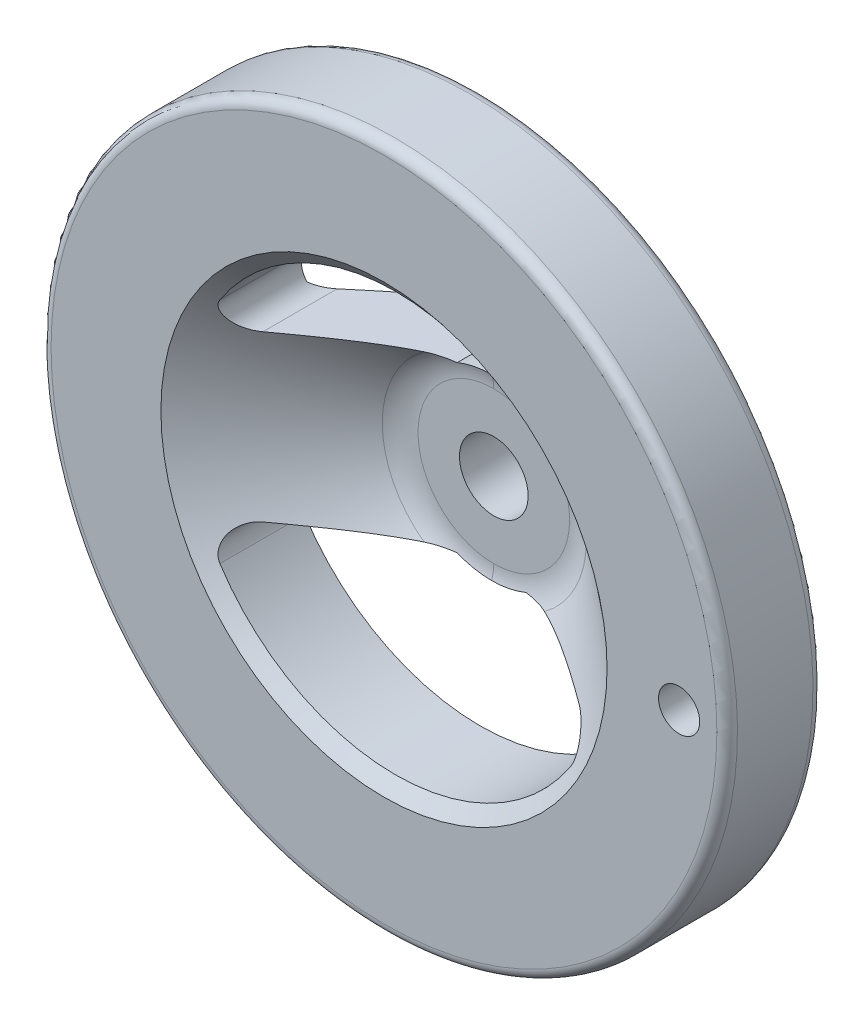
ISO-10303-21;
HEADER;
FILE_DESCRIPTION(('STEP AP214'),'2;1');
FILE_NAME('part.step','',(''),(''),'','','');
FILE_SCHEMA(('AUTOMOTIVE_DESIGN { 1 0 10303 214 1 1 1 1 }'));
ENDSEC;
DATA;
#1=APPLICATION_CONTEXT('core data for automotive mechanical design processes');
#2=APPLICATION_PROTOCOL_DEFINITION('international standard','automotive_design',2000,#1);
#3=PRODUCT_CONTEXT('',#1,'mechanical');
#4=PRODUCT('Part','Part','',(#3));
#5=PRODUCT_RELATED_PRODUCT_CATEGORY('part','',(#4));
#6=PRODUCT_DEFINITION_FORMATION('','',#4);
#7=PRODUCT_DEFINITION_CONTEXT('part definition',#1,'design');
#8=PRODUCT_DEFINITION('design','',#6,#7);
#9=PRODUCT_DEFINITION_SHAPE('','',#8);
#10=(LENGTH_UNIT() NAMED_UNIT(*) SI_UNIT(.MILLI.,.METRE.));
#11=(NAMED_UNIT(*) PLANE_ANGLE_UNIT() SI_UNIT($,.RADIAN.));
#12=(NAMED_UNIT(*) SI_UNIT($,.STERADIAN.) SOLID_ANGLE_UNIT());
#13=UNCERTAINTY_MEASURE_WITH_UNIT(LENGTH_MEASURE(1.E-05),#10,'distance_accuracy_value','');
#14=(GEOMETRIC_REPRESENTATION_CONTEXT(3) GLOBAL_UNCERTAINTY_ASSIGNED_CONTEXT((#13)) GLOBAL_UNIT_ASSIGNED_CONTEXT((#10,
#11,#12)) REPRESENTATION_CONTEXT('',''));
#15=CARTESIAN_POINT('',(0.,0.,0.));
#16=DIRECTION('',(0.,0.,1.));
#17=DIRECTION('',(1.,0.,0.));
#18=AXIS2_PLACEMENT_3D('',#15,#16,#17);
#19=CARTESIAN_POINT('',(0.,0.,0.));
#20=DIRECTION('',(0.,0.,1.));
#21=DIRECTION('',(0.,-1.,0.));
#22=AXIS2_PLACEMENT_3D('',#19,#20,#21);
#23=CYLINDRICAL_SURFACE('',#22,5.);
#24=CARTESIAN_POINT('',(0.,0.,17.));
#25=DIRECTION('',(0.,0.,1.));
#26=DIRECTION('',(0.,-1.,0.));
#27=AXIS2_PLACEMENT_3D('',#24,#25,#26);
#28=CIRCLE('',#27,5.);
#29=CARTESIAN_POINT('',(0.,-5.,17.));
#30=VERTEX_POINT('',#29);
#31=EDGE_CURVE('E761',#30,#30,#28,.T.);
#32=ORIENTED_EDGE('',*,*,#31,.T.);
#33=EDGE_LOOP('',(#32));
#34=FACE_BOUND('',#33,.T.);
#35=CARTESIAN_POINT('',(0.,0.,0.));
#36=DIRECTION('',(0.,0.,1.));
#37=DIRECTION('',(0.,-1.,0.));
#38=AXIS2_PLACEMENT_3D('',#35,#36,#37);
#39=CIRCLE('',#38,5.);
#40=CARTESIAN_POINT('',(0.,-5.,0.));
#41=VERTEX_POINT('',#40);
#42=EDGE_CURVE('E18',#41,#41,#39,.F.);
#43=ORIENTED_EDGE('',*,*,#42,.T.);
#44=EDGE_LOOP('',(#43));
#45=FACE_BOUND('',#44,.T.);
#46=ADVANCED_FACE('F14',(#34,#45),#23,.F.);
#47=CARTESIAN_POINT('',(-13.194524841,13.164845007,0.));
#48=DIRECTION('',(0.,0.,1.));
#49=DIRECTION('',(0.,-1.,0.));
#50=AXIS2_PLACEMENT_3D('',#47,#48,#49);
#51=PLANE('',#50);
#52=ORIENTED_EDGE('',*,*,#42,.F.);
#53=EDGE_LOOP('',(#52));
#54=FACE_BOUND('',#53,.T.);
#55=CARTESIAN_POINT('',(0.,0.,0.));
#56=DIRECTION('',(0.,0.,1.));
#57=DIRECTION('',(0.,-1.,0.));
#58=AXIS2_PLACEMENT_3D('',#55,#56,#57);
#59=CIRCLE('',#58,13.);
#60=CARTESIAN_POINT('',(-5.,-12.,0.));
#61=VERTEX_POINT('',#60);
#62=CARTESIAN_POINT('',(5.00000000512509,-11.9999999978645,0.));
#63=VERTEX_POINT('',#62);
#64=EDGE_CURVE('E752',#61,#63,#59,.T.);
#65=ORIENTED_EDGE('',*,*,#64,.F.);
#66=DIRECTION('',(-1.,0.,0.));
#67=VECTOR('',#66,1.);
#68=CARTESIAN_POINT('',(-14.0244305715,-12.,0.));
#69=LINE('',#68,#67);
#70=CARTESIAN_POINT('',(-5.00102907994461,-11.9999999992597,0.));
#71=VERTEX_POINT('',#70);
#72=EDGE_CURVE('E299',#61,#71,#69,.T.);
#73=ORIENTED_EDGE('',*,*,#72,.T.);
#74=CARTESIAN_POINT('',(0.,0.,0.));
#75=DIRECTION('',(0.,0.,-1.));
#76=DIRECTION('',(0.,1.,0.));
#77=AXIS2_PLACEMENT_3D('',#74,#75,#76);
#78=CIRCLE('',#77,13.000395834);
#79=CARTESIAN_POINT('',(-5.00102907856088,11.9999999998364,0.));
#80=VERTEX_POINT('',#79);
#81=EDGE_CURVE('E526',#80,#71,#78,.F.);
#82=ORIENTED_EDGE('',*,*,#81,.F.);
#83=DIRECTION('',(1.,0.,0.));
#84=VECTOR('',#83,1.);
#85=CARTESIAN_POINT('',(-14.0244305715,12.,0.));
#86=LINE('',#85,#84);
#87=CARTESIAN_POINT('',(-5.,12.,0.));
#88=VERTEX_POINT('',#87);
#89=EDGE_CURVE('E290',#80,#88,#86,.T.);
#90=ORIENTED_EDGE('',*,*,#89,.T.);
#91=CARTESIAN_POINT('',(0.,0.,0.));
#92=DIRECTION('',(0.,0.,1.));
#93=DIRECTION('',(0.,-1.,0.));
#94=AXIS2_PLACEMENT_3D('',#91,#92,#93);
#95=CIRCLE('',#94,13.);
#96=CARTESIAN_POINT('',(5.00000001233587,11.9999999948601,0.));
#97=VERTEX_POINT('',#96);
#98=EDGE_CURVE('E756',#97,#88,#95,.T.);
#99=ORIENTED_EDGE('',*,*,#98,.F.);
#100=DIRECTION('',(-1.,0.,0.));
#101=VECTOR('',#100,1.);
#102=CARTESIAN_POINT('',(0.,11.9999999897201,0.));
#103=LINE('',#102,#101);
#104=CARTESIAN_POINT('',(5.00102908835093,11.9999999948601,0.));
#105=VERTEX_POINT('',#104);
#106=EDGE_CURVE('E578',#105,#97,#103,.T.);
#107=ORIENTED_EDGE('',*,*,#106,.F.);
#108=CARTESIAN_POINT('',(0.,0.,0.));
#109=DIRECTION('',(0.,0.,-1.));
#110=DIRECTION('',(0.,1.,0.));
#111=AXIS2_PLACEMENT_3D('',#108,#109,#110);
#112=CIRCLE('',#111,13.000395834);
#113=CARTESIAN_POINT('',(5.00102908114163,-11.9999999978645,0.));
#114=VERTEX_POINT('',#113);
#115=EDGE_CURVE('E306',#114,#105,#112,.F.);
#116=ORIENTED_EDGE('',*,*,#115,.F.);
#117=DIRECTION('',(1.,0.,0.));
#118=VECTOR('',#117,1.);
#119=CARTESIAN_POINT('',(0.,-11.9999999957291,0.));
#120=LINE('',#119,#118);
#121=EDGE_CURVE('E758',#63,#114,#120,.T.);
#122=ORIENTED_EDGE('',*,*,#121,.F.);
#123=EDGE_LOOP('',(#65,#73,#82,#90,#99,#107,#116,#122));
#124=FACE_BOUND('',#123,.T.);
#125=ADVANCED_FACE('F553',(#54,#124),#51,.F.);
#126=CARTESIAN_POINT('',(0.,0.,31.500069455));
#127=DIRECTION('',(0.,0.,-1.));
#128=DIRECTION('',(0.,1.,0.));
#129=AXIS2_PLACEMENT_3D('',#126,#127,#128);
#130=TOROIDAL_SURFACE('',#129,48.500138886,1.5);
#131=CARTESIAN_POINT('',(0.,0.,31.500069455));
#132=DIRECTION('',(0.,0.,-1.));
#133=DIRECTION('',(0.,1.,0.));
#134=AXIS2_PLACEMENT_3D('',#131,#132,#133);
#135=CIRCLE('',#134,50.000138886);
#136=CARTESIAN_POINT('',(0.,50.000138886,31.500069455));
#137=VERTEX_POINT('',#136);
#138=EDGE_CURVE('E303',#137,#137,#135,.T.);
#139=ORIENTED_EDGE('',*,*,#138,.F.);
#140=EDGE_LOOP('',(#139));
#141=FACE_BOUND('',#140,.T.);
#142=CARTESIAN_POINT('',(0.,0.,33.000069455));
#143=DIRECTION('',(0.,0.,-1.));
#144=DIRECTION('',(0.,1.,0.));
#145=AXIS2_PLACEMENT_3D('',#142,#143,#144);
#146=CIRCLE('',#145,48.5001388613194);
#147=CARTESIAN_POINT('',(0.,48.5001388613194,33.000069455));
#148=VERTEX_POINT('',#147);
#149=EDGE_CURVE('E486',#148,#148,#146,.T.);
#150=ORIENTED_EDGE('',*,*,#149,.T.);
#151=EDGE_LOOP('',(#150));
#152=FACE_BOUND('',#151,.T.);
#153=ADVANCED_FACE('F534',(#141,#152),#130,.T.);
#154=CARTESIAN_POINT('',(-11.208790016,-11.170353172,17.));
#155=DIRECTION('',(0.,0.,-1.));
#156=DIRECTION('',(0.,1.,0.));
#157=AXIS2_PLACEMENT_3D('',#154,#155,#156);
#158=PLANE('',#157);
#159=ORIENTED_EDGE('',*,*,#31,.F.);
#160=EDGE_LOOP('',(#159));
#161=FACE_BOUND('',#160,.T.);
#162=CARTESIAN_POINT('',(0.,-11.0378983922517,17.));
#163=CARTESIAN_POINT('',(-22.0757967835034,-11.0378983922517,17.));
#164=CARTESIAN_POINT('',(-22.0757967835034,11.0378983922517,17.));
#165=CARTESIAN_POINT('',(0.,11.0378983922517,17.));
#166=(BOUNDED_CURVE() B_SPLINE_CURVE(3,(#162,#163,#164,#165),.UNSPECIFIED.,.F.,
.F.) B_SPLINE_CURVE_WITH_KNOTS((4,4),(0.,1.),
.UNSPECIFIED.) CURVE() GEOMETRIC_REPRESENTATION_ITEM() RATIONAL_B_SPLINE_CURVE((0.999999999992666,
0.333333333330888,0.333333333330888,0.999999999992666)) REPRESENTATION_ITEM(''));
#167=CARTESIAN_POINT('',(0.,11.0378983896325,17.));
#168=VERTEX_POINT('',#167);
#169=CARTESIAN_POINT('',(0.,-11.0378983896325,17.));
#170=VERTEX_POINT('',#169);
#171=EDGE_CURVE('E312',#168,#170,#166,.F.);
#172=ORIENTED_EDGE('',*,*,#171,.T.);
#173=CARTESIAN_POINT('',(0.,11.0378983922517,17.));
#174=CARTESIAN_POINT('',(22.0757967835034,11.0378983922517,17.));
#175=CARTESIAN_POINT('',(22.0757967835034,-11.0378983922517,17.));
#176=CARTESIAN_POINT('',(0.,-11.0378983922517,17.));
#177=(BOUNDED_CURVE() B_SPLINE_CURVE(3,(#173,#174,#175,#176),.UNSPECIFIED.,.F.,
.F.) B_SPLINE_CURVE_WITH_KNOTS((4,4),(0.,1.),
.UNSPECIFIED.) CURVE() GEOMETRIC_REPRESENTATION_ITEM() RATIONAL_B_SPLINE_CURVE((0.999999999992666,
0.333333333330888,0.333333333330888,0.999999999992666)) REPRESENTATION_ITEM(''));
#178=EDGE_CURVE('E152',#170,#168,#177,.F.);
#179=ORIENTED_EDGE('',*,*,#178,.T.);
#180=EDGE_LOOP('',(#172,#179));
#181=FACE_BOUND('',#180,.T.);
#182=ADVANCED_FACE('F364',(#161,#181),#158,.F.);
#183=CARTESIAN_POINT('',(0.,0.,0.));
#184=DIRECTION('',(0.,0.,1.));
#185=DIRECTION('',(0.,-1.,0.));
#186=AXIS2_PLACEMENT_3D('',#183,#184,#185);
#187=CYLINDRICAL_SURFACE('',#186,13.);
#188=DIRECTION('',(0.,0.,1.));
#189=VECTOR('',#188,1.);
#190=CARTESIAN_POINT('',(5.,-12.,13.8821988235));
#191=LINE('',#190,#189);
#192=CARTESIAN_POINT('',(4.99999999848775,-12.,17.3298891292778));
#193=VERTEX_POINT('',#192);
#194=EDGE_CURVE('E143',#63,#193,#191,.T.);
#195=ORIENTED_EDGE('',*,*,#194,.T.);
#196=CARTESIAN_POINT('',(0.,0.,17.3298891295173));
#197=DIRECTION('',(0.,0.,-1.));
#198=DIRECTION('',(0.,1.,0.));
#199=AXIS2_PLACEMENT_3D('',#196,#197,#198);
#200=CIRCLE('',#199,12.9999999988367);
#201=CARTESIAN_POINT('',(0.,-12.9999999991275,17.3298891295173));
#202=VERTEX_POINT('',#201);
#203=EDGE_CURVE('E460',#193,#202,#200,.T.);
#204=ORIENTED_EDGE('',*,*,#203,.T.);
#205=CARTESIAN_POINT('',(0.,0.,17.3298891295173));
#206=DIRECTION('',(0.,0.,-1.));
#207=DIRECTION('',(0.,1.,0.));
#208=AXIS2_PLACEMENT_3D('',#205,#206,#207);
#209=CIRCLE('',#208,12.9999999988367);
#210=CARTESIAN_POINT('',(-4.99999999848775,-12.,17.3298891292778));
#211=VERTEX_POINT('',#210);
#212=EDGE_CURVE('E307',#202,#211,#209,.T.);
#213=ORIENTED_EDGE('',*,*,#212,.T.);
#214=DIRECTION('',(0.,0.,-1.));
#215=VECTOR('',#214,1.);
#216=CARTESIAN_POINT('',(-5.,-12.,13.8821988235));
#217=LINE('',#216,#215);
#218=EDGE_CURVE('E302',#211,#61,#217,.T.);
#219=ORIENTED_EDGE('',*,*,#218,.T.);
#220=ORIENTED_EDGE('',*,*,#64,.T.);
#221=EDGE_LOOP('',(#195,#204,#213,#219,#220));
#222=FACE_BOUND('',#221,.T.);
#223=ADVANCED_FACE('F561',(#222),#187,.T.);
#224=CARTESIAN_POINT('',(0.,0.,0.));
#225=DIRECTION('',(0.,0.,1.));
#226=DIRECTION('',(0.,-1.,0.));
#227=AXIS2_PLACEMENT_3D('',#224,#225,#226);
#228=CYLINDRICAL_SURFACE('',#227,13.);
#229=CARTESIAN_POINT('',(0.,0.,17.3298891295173));
#230=DIRECTION('',(0.,0.,-1.));
#231=DIRECTION('',(0.,1.,0.));
#232=AXIS2_PLACEMENT_3D('',#229,#230,#231);
#233=CIRCLE('',#232,12.9999999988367);
#234=CARTESIAN_POINT('',(-5.00000000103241,12.,17.3298891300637));
#235=VERTEX_POINT('',#234);
#236=CARTESIAN_POINT('',(0.,12.9999999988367,17.3298891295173));
#237=VERTEX_POINT('',#236);
#238=EDGE_CURVE('E754',#235,#237,#233,.T.);
#239=ORIENTED_EDGE('',*,*,#238,.T.);
#240=CARTESIAN_POINT('',(0.,0.,17.3298891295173));
#241=DIRECTION('',(0.,0.,-1.));
#242=DIRECTION('',(0.,1.,0.));
#243=AXIS2_PLACEMENT_3D('',#240,#241,#242);
#244=CIRCLE('',#243,12.9999999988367);
#245=CARTESIAN_POINT('',(4.99999999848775,12.,17.3298891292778));
#246=VERTEX_POINT('',#245);
#247=EDGE_CURVE('E469',#237,#246,#244,.T.);
#248=ORIENTED_EDGE('',*,*,#247,.T.);
#249=DIRECTION('',(0.,0.,-1.));
#250=VECTOR('',#249,1.);
#251=CARTESIAN_POINT('',(5.,12.,13.8821988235));
#252=LINE('',#251,#250);
#253=EDGE_CURVE('E253',#246,#97,#252,.T.);
#254=ORIENTED_EDGE('',*,*,#253,.T.);
#255=ORIENTED_EDGE('',*,*,#98,.T.);
#256=DIRECTION('',(0.,0.,1.));
#257=VECTOR('',#256,1.);
#258=CARTESIAN_POINT('',(-5.,12.,13.8821988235));
#259=LINE('',#258,#257);
#260=EDGE_CURVE('E298',#88,#235,#259,.T.);
#261=ORIENTED_EDGE('',*,*,#260,.T.);
#262=EDGE_LOOP('',(#239,#248,#254,#255,#261));
#263=FACE_BOUND('',#262,.T.);
#264=ADVANCED_FACE('F331',(#263),#228,.T.);
#265=CARTESIAN_POINT('',(0.,-11.037898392,17.));
#266=CARTESIAN_POINT('',(-22.075796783,-11.037898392,17.));
#267=CARTESIAN_POINT('',(-22.075796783,11.037898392,17.));
#268=CARTESIAN_POINT('',(0.,11.037898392,17.));
#269=CARTESIAN_POINT('',(0.,-12.450713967,17.));
#270=CARTESIAN_POINT('',(-24.901427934,-12.450713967,17.));
#271=CARTESIAN_POINT('',(-24.901427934,12.450713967,17.));
#272=CARTESIAN_POINT('',(0.,12.450713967,17.));
#273=CARTESIAN_POINT('',(0.,-13.779749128,17.47928425));
#274=CARTESIAN_POINT('',(-27.559498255,-13.779749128,17.47928425));
#275=CARTESIAN_POINT('',(-27.559498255,13.779749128,17.47928425));
#276=CARTESIAN_POINT('',(0.,13.779749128,17.47928425));
#277=CARTESIAN_POINT('',(0.,-14.867379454,18.381009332));
#278=CARTESIAN_POINT('',(-29.734758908,-14.867379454,18.381009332));
#279=CARTESIAN_POINT('',(-29.734758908,14.867379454,18.381009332));
#280=CARTESIAN_POINT('',(0.,14.867379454,18.381009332));
#281=(BOUNDED_SURFACE() B_SPLINE_SURFACE(3,3,((#265,#266,#267,#268),(#269,#270,#271,#272),(#273,
#274,#275,#276),(#277,#278,#279,#280)),.UNSPECIFIED.,.F.,.F.,
.F.) B_SPLINE_SURFACE_WITH_KNOTS((4,4),(4,4),(0.,1.),(0.,1.),
.UNSPECIFIED.) GEOMETRIC_REPRESENTATION_ITEM() RATIONAL_B_SPLINE_SURFACE(((1.,0.333333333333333,
0.333333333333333,1.),(0.96046645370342,0.320155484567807,0.320155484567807,0.96046645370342),
(0.96046645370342,0.320155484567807,0.320155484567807,0.96046645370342),(1.,0.333333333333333,
0.333333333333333,1.))) REPRESENTATION_ITEM('') SURFACE());
#282=CARTESIAN_POINT('',(0.,-11.037898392,17.));
#283=CARTESIAN_POINT('',(0.,-12.450713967,17.));
#284=CARTESIAN_POINT('',(0.,-13.779749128,17.47928425));
#285=CARTESIAN_POINT('',(0.,-14.867379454,18.381009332));
#286=(BOUNDED_CURVE() B_SPLINE_CURVE(3,(#282,#283,#284,#285),.UNSPECIFIED.,.F.,
.F.) B_SPLINE_CURVE_WITH_KNOTS((4,4),(0.,1.),
.UNSPECIFIED.) CURVE() GEOMETRIC_REPRESENTATION_ITEM() RATIONAL_B_SPLINE_CURVE((1.,
0.96046645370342,0.96046645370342,1.)) REPRESENTATION_ITEM(''));
#287=EDGE_CURVE('E254',#202,#170,#286,.F.);
#288=CARTESIAN_POINT('',(0.,11.037898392,17.));
#289=CARTESIAN_POINT('',(0.,12.450713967,17.));
#290=CARTESIAN_POINT('',(0.,13.779749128,17.47928425));
#291=CARTESIAN_POINT('',(0.,14.867379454,18.381009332));
#292=(BOUNDED_CURVE() B_SPLINE_CURVE(3,(#288,#289,#290,#291),.UNSPECIFIED.,.F.,
.F.) B_SPLINE_CURVE_WITH_KNOTS((4,4),(0.,1.),
.UNSPECIFIED.) CURVE() GEOMETRIC_REPRESENTATION_ITEM() RATIONAL_B_SPLINE_CURVE((1.,
0.96046645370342,0.96046645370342,1.)) REPRESENTATION_ITEM(''));
#293=EDGE_CURVE('E465',#168,#237,#292,.T.);
#294=CARTESIAN_POINT('',(-5.00000000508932,12.,17.3298891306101));
#295=CARTESIAN_POINT('',(-5.10747465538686,12.,17.3441946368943));
#296=CARTESIAN_POINT('',(-5.21483727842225,12.,17.3593818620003));
#297=CARTESIAN_POINT('',(-5.42930255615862,12.,17.391680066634));
#298=CARTESIAN_POINT('',(-5.53640513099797,12.,17.4087915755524));
#299=CARTESIAN_POINT('',(-5.75026237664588,12.,17.4450921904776));
#300=CARTESIAN_POINT('',(-5.85701702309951,12.,17.4642814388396));
#301=CARTESIAN_POINT('',(-6.28113015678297,12.,17.5451178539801));
#302=CARTESIAN_POINT('',(-6.59687892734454,12.,17.6155888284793));
#303=CARTESIAN_POINT('',(-7.22940253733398,12.,17.782830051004));
#304=CARTESIAN_POINT('',(-7.54603125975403,12.,17.8801724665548));
#305=CARTESIAN_POINT('',(-7.96147603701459,12.,18.0304042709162));
#306=CARTESIAN_POINT('',(-8.06522140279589,12.,18.0698515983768));
#307=CARTESIAN_POINT('',(-8.27129835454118,12.,18.1523530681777));
#308=CARTESIAN_POINT('',(-8.3736296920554,12.,18.1954078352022));
#309=CARTESIAN_POINT('',(-8.57668862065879,12.,18.2853186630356));
#310=CARTESIAN_POINT('',(-8.67741509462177,12.,18.3321772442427));
#311=CARTESIAN_POINT('',(-8.7771847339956,12.,18.38100933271));
#312=B_SPLINE_CURVE_WITH_KNOTS('',3,(#294,#295,#296,#297,#298,#299,#300,#301,#302,#303,#304,
#305,#306,#307,#308,#309,#310,#311),.UNSPECIFIED.,.F.,.F.,(4,2,2,2,2,2,2,2,4),(0.,
0.325272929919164,0.65063556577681,0.976020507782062,1.94579706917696,2.93807053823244,
3.27099515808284,3.60397754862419,3.93718240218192),.UNSPECIFIED.);
#313=CARTESIAN_POINT('',(-8.77718473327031,12.,18.381009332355));
#314=VERTEX_POINT('',#313);
#315=EDGE_CURVE('E341',#235,#314,#312,.T.);
#316=CARTESIAN_POINT('',(0.,0.,18.381009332));
#317=DIRECTION('',(0.,0.,1.));
#318=DIRECTION('',(0.,-1.,0.));
#319=AXIS2_PLACEMENT_3D('',#316,#317,#318);
#320=CIRCLE('',#319,14.867379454);
#321=CARTESIAN_POINT('',(-8.77718473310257,-12.,18.3810093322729));
#322=VERTEX_POINT('',#321);
#323=EDGE_CURVE('E452',#314,#322,#320,.T.);
#324=CARTESIAN_POINT('',(-8.77718473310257,-12.,18.3810093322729));
#325=CARTESIAN_POINT('',(-8.67999373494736,-12.,18.3334392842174));
#326=CARTESIAN_POINT('',(-8.58189430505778,-12.,18.2877419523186));
#327=CARTESIAN_POINT('',(-8.38416295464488,-12.,18.1999625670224));
#328=CARTESIAN_POINT('',(-8.28453203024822,-12.,18.1578782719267));
#329=CARTESIAN_POINT('',(-8.08391640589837,-12.,18.0771423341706));
#330=CARTESIAN_POINT('',(-7.9829319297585,-12.,18.0384901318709));
#331=CARTESIAN_POINT('',(-7.57854022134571,-12.,17.8910917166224));
#332=CARTESIAN_POINT('',(-7.27039900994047,-12.,17.7951601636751));
#333=CARTESIAN_POINT('',(-6.63858554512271,-12.,17.6253033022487));
#334=CARTESIAN_POINT('',(-6.31472300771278,-12.,17.5521077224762));
#335=CARTESIAN_POINT('',(-5.87959281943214,-12.,17.4684170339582));
#336=CARTESIAN_POINT('',(-5.7700371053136,-12.,17.4485739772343));
#337=CARTESIAN_POINT('',(-5.55055638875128,-12.,17.4110863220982));
#338=CARTESIAN_POINT('',(-5.4406314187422,-12.,17.3934415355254));
#339=CARTESIAN_POINT('',(-5.22051007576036,-12.,17.360185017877));
#340=CARTESIAN_POINT('',(-5.11031380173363,-12.,17.3445726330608));
#341=CARTESIAN_POINT('',(-5.00000000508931,-12.,17.3298891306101));
#342=B_SPLINE_CURVE_WITH_KNOTS('',3,(#324,#325,#326,#327,#328,#329,#330,#331,#332,#333,#334,
#335,#336,#337,#338,#339,#340,#341),.UNSPECIFIED.,.F.,.F.,(4,2,2,2,2,2,2,2,4),(0.,
0.324594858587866,0.648986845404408,0.973325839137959,1.94012452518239,2.93534099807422,
3.26934389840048,3.60331819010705,3.93718478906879),.UNSPECIFIED.);
#343=EDGE_CURVE('E348',#322,#211,#342,.T.);
#344=ORIENTED_EDGE('',*,*,#287,.T.);
#345=ORIENTED_EDGE('',*,*,#171,.F.);
#346=ORIENTED_EDGE('',*,*,#293,.T.);
#347=ORIENTED_EDGE('',*,*,#238,.F.);
#348=ORIENTED_EDGE('',*,*,#315,.T.);
#349=ORIENTED_EDGE('',*,*,#323,.T.);
#350=ORIENTED_EDGE('',*,*,#343,.T.);
#351=ORIENTED_EDGE('',*,*,#212,.F.);
#352=EDGE_LOOP('',(#344,#345,#346,#347,#348,#349,#350,#351));
#353=FACE_BOUND('',#352,.T.);
#354=ADVANCED_FACE('F318',(#353),#281,.F.);
#355=CARTESIAN_POINT('',(0.,0.,31.500069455));
#356=DIRECTION('',(0.,0.,-1.));
#357=DIRECTION('',(0.,1.,0.));
#358=AXIS2_PLACEMENT_3D('',#355,#356,#357);
#359=CYLINDRICAL_SURFACE('',#358,50.000138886);
#360=CARTESIAN_POINT('',(0.,0.,20.500180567));
#361=DIRECTION('',(0.,0.,-1.));
#362=DIRECTION('',(0.,1.,0.));
#363=AXIS2_PLACEMENT_3D('',#360,#361,#362);
#364=CIRCLE('',#363,50.000138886);
#365=CARTESIAN_POINT('',(0.,50.000138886,20.500180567));
#366=VERTEX_POINT('',#365);
#367=EDGE_CURVE('E443',#366,#366,#364,.T.);
#368=ORIENTED_EDGE('',*,*,#367,.F.);
#369=EDGE_LOOP('',(#368));
#370=FACE_BOUND('',#369,.T.);
#371=ORIENTED_EDGE('',*,*,#138,.T.);
#372=EDGE_LOOP('',(#371));
#373=FACE_BOUND('',#372,.T.);
#374=ADVANCED_FACE('F330',(#370,#373),#359,.T.);
#375=CARTESIAN_POINT('',(0.,0.,4.348006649));
#376=DIRECTION('',(0.,0.,-1.));
#377=DIRECTION('',(0.,1.,0.));
#378=AXIS2_PLACEMENT_3D('',#375,#376,#377);
#379=CYLINDRICAL_SURFACE('',#378,13.000395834);
#380=ORIENTED_EDGE('',*,*,#115,.T.);
#381=DIRECTION('',(0.,0.,1.));
#382=VECTOR('',#381,1.);
#383=CARTESIAN_POINT('',(5.00102907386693,12.,13.8821988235));
#384=LINE('',#383,#382);
#385=CARTESIAN_POINT('',(5.0010290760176,12.,4.34800664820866));
#386=VERTEX_POINT('',#385);
#387=EDGE_CURVE('E494',#105,#386,#384,.T.);
#388=ORIENTED_EDGE('',*,*,#387,.T.);
#389=CARTESIAN_POINT('',(0.,0.,4.34800664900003));
#390=DIRECTION('',(0.,0.,1.));
#391=DIRECTION('',(0.,-1.,0.));
#392=AXIS2_PLACEMENT_3D('',#389,#390,#391);
#393=CIRCLE('',#392,13.000395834);
#394=CARTESIAN_POINT('',(5.00102907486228,-12.,4.34800664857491));
#395=VERTEX_POINT('',#394);
#396=EDGE_CURVE('E455',#395,#386,#393,.T.);
#397=ORIENTED_EDGE('',*,*,#396,.F.);
#398=DIRECTION('',(0.,0.,-1.));
#399=VECTOR('',#398,1.);
#400=CARTESIAN_POINT('',(5.00102907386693,-12.,13.8821988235));
#401=LINE('',#400,#399);
#402=EDGE_CURVE('E479',#395,#114,#401,.T.);
#403=ORIENTED_EDGE('',*,*,#402,.T.);
#404=EDGE_LOOP('',(#380,#388,#397,#403));
#405=FACE_BOUND('',#404,.T.);
#406=ADVANCED_FACE('F362',(#405),#379,.T.);
#407=CARTESIAN_POINT('',(-23.048861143,-12.,0.));
#408=DIRECTION('',(0.,1.,0.));
#409=DIRECTION('',(0.,0.,1.));
#410=AXIS2_PLACEMENT_3D('',#407,#408,#409);
#411=PLANE('',#410);
#412=ORIENTED_EDGE('',*,*,#72,.F.);
#413=ORIENTED_EDGE('',*,*,#218,.F.);
#414=ORIENTED_EDGE('',*,*,#343,.F.);
#415=CARTESIAN_POINT('',(-8.77718473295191,-11.9999999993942,18.3810093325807));
#416=CARTESIAN_POINT('',(-9.0961743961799,-11.9999999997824,18.5371845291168));
#417=CARTESIAN_POINT('',(-9.41297761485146,-11.9999999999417,18.6977474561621));
#418=CARTESIAN_POINT('',(-10.0425774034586,-12.0000000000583,19.0264320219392));
#419=CARTESIAN_POINT('',(-10.3553746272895,-12.0000000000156,19.1945524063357));
#420=CARTESIAN_POINT('',(-10.9772340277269,-11.9999999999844,19.53707749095));
#421=CARTESIAN_POINT('',(-11.2862984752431,-11.9999999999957,19.7114780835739));
#422=CARTESIAN_POINT('',(-11.9012868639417,-12.0000000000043,20.0657531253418));
#423=CARTESIAN_POINT('',(-12.2072106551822,-12.0000000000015,20.245627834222));
#424=CARTESIAN_POINT('',(-13.1197436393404,-11.999999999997,20.7916255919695));
#425=CARTESIAN_POINT('',(-13.7221844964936,-11.9999999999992,21.1647188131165));
#426=CARTESIAN_POINT('',(-14.9183188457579,-12.0000000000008,21.9248277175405));
#427=CARTESIAN_POINT('',(-15.5120106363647,-12.0000000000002,22.3118460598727));
#428=CARTESIAN_POINT('',(-16.6914732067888,-11.9999999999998,23.0959244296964));
#429=CARTESIAN_POINT('',(-17.2772541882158,-11.9999999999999,23.4929691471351));
#430=CARTESIAN_POINT('',(-18.443144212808,-12.0000000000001,24.295302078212));
#431=CARTESIAN_POINT('',(-19.0232531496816,-12.,24.7005904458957));
#432=CARTESIAN_POINT('',(-20.1797893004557,-12.,25.5183626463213));
#433=CARTESIAN_POINT('',(-20.7562089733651,-12.,25.9308571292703));
#434=CARTESIAN_POINT('',(-21.6179761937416,-12.,26.5535552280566));
#435=CARTESIAN_POINT('',(-21.9047560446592,-12.,26.7617815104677));
#436=CARTESIAN_POINT('',(-22.4774423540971,-12.,27.1794280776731));
#437=CARTESIAN_POINT('',(-22.7633488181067,-12.,27.3888483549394));
#438=CARTESIAN_POINT('',(-23.0488611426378,-12.,27.5988048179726));
#439=B_SPLINE_CURVE_WITH_KNOTS('',3,(#415,#416,#417,#418,#419,#420,#421,#422,#423,#424,#425,
#426,#427,#428,#429,#430,#431,#432,#433,#434,#435,#436,#437,#438),.UNSPECIFIED.,.F.,.F.,(4,2,2,
2,2,2,2,2,2,2,2,4),(0.,1.06542364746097,2.13067111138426,3.19523406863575,4.25984761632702,
6.3854011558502,8.51136275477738,10.634253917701,12.7571847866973,14.8835754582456,
15.9467794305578,17.0099767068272),.UNSPECIFIED.);
#440=CARTESIAN_POINT('',(-23.0488611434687,-12.,27.5988048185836));
#441=VERTEX_POINT('',#440);
#442=EDGE_CURVE('E370',#322,#441,#439,.T.);
#443=ORIENTED_EDGE('',*,*,#442,.T.);
#444=DIRECTION('',(0.,0.,-1.));
#445=VECTOR('',#444,1.);
#446=CARTESIAN_POINT('',(-23.0488611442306,-12.,24.0551029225));
#447=LINE('',#446,#445);
#448=CARTESIAN_POINT('',(-23.0488611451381,-12.,16.7686108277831));
#449=VERTEX_POINT('',#448);
#450=EDGE_CURVE('E386',#441,#449,#447,.T.);
#451=ORIENTED_EDGE('',*,*,#450,.T.);
#452=CARTESIAN_POINT('',(-5.0010290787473,-12.,4.34800664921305));
#453=CARTESIAN_POINT('',(-5.21482366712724,-12.,4.42667998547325));
#454=CARTESIAN_POINT('',(-5.42719738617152,-12.,4.50911563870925));
#455=CARTESIAN_POINT('',(-5.84914360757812,-12.,4.68074470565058));
#456=CARTESIAN_POINT('',(-6.05871674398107,-12.,4.7699365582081));
#457=CARTESIAN_POINT('',(-6.68295021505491,-12.,5.04633576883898));
#458=CARTESIAN_POINT('',(-7.09362972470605,-12.,5.24255636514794));
#459=CARTESIAN_POINT('',(-7.90378334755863,-12.,5.6532471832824));
#460=CARTESIAN_POINT('',(-8.30329248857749,-12.,5.86764913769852));
#461=CARTESIAN_POINT('',(-9.09397832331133,-12.,6.31153123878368));
#462=CARTESIAN_POINT('',(-9.48515220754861,-12.,6.54101636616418));
#463=CARTESIAN_POINT('',(-10.257831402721,-12.,7.010584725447));
#464=CARTESIAN_POINT('',(-10.6393807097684,-12.,7.25059592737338));
#465=CARTESIAN_POINT('',(-11.396263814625,-12.,7.74023528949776));
#466=CARTESIAN_POINT('',(-11.7715973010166,-12.,7.98986392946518));
#467=CARTESIAN_POINT('',(-12.5172809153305,-12.,8.49722226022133));
#468=CARTESIAN_POINT('',(-12.8876257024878,-12.,8.75495977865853));
#469=CARTESIAN_POINT('',(-13.6237130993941,-12.,9.27693124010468));
#470=CARTESIAN_POINT('',(-13.9894555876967,-12.,9.54116535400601));
#471=CARTESIAN_POINT('',(-14.7264926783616,-12.,10.0820323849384));
#472=CARTESIAN_POINT('',(-15.0976818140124,-12.,10.3588087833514));
#473=CARTESIAN_POINT('',(-15.8364574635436,-12.,10.9171326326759));
#474=CARTESIAN_POINT('',(-16.2040439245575,-12.,11.1986801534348));
#475=CARTESIAN_POINT('',(-16.9359294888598,-12.,11.7656763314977));
#476=CARTESIAN_POINT('',(-17.3002299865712,-12.,12.0511231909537));
#477=CARTESIAN_POINT('',(-18.0261177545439,-12.,12.6254470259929));
#478=CARTESIAN_POINT('',(-18.3877050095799,-12.,12.9143240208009));
#479=CARTESIAN_POINT('',(-19.1105363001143,-12.,13.4966567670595));
#480=CARTESIAN_POINT('',(-19.4717669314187,-12.,13.7901291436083));
#481=CARTESIAN_POINT('',(-20.1921227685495,-12.,14.3796469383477));
#482=CARTESIAN_POINT('',(-20.5512479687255,-12.,14.6756923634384));
#483=CARTESIAN_POINT('',(-21.2677357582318,-12.,15.2700944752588));
#484=CARTESIAN_POINT('',(-21.62509786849,-12.,15.5684517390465));
#485=CARTESIAN_POINT('',(-22.3381675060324,-12.,16.1671271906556));
#486=CARTESIAN_POINT('',(-22.6938750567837,-12.,16.4674453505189));
#487=CARTESIAN_POINT('',(-23.0488611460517,-12.,16.7686108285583));
#488=B_SPLINE_CURVE_WITH_KNOTS('',3,(#452,#453,#454,#455,#456,#457,#458,#459,#460,#461,#462,
#463,#464,#465,#466,#467,#468,#469,#470,#471,#472,#473,#474,#475,#476,#477,#478,#479,#480,#481,
#482,#483,#484,#485,#486,#487),.UNSPECIFIED.,.F.,.F.,(4,2,2,2,2,2,2,2,2,2,2,2,2,2,2,2,2,4),(0.,
0.683341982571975,1.36652654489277,2.73127982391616,4.09111820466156,5.45140790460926,
6.80351754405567,8.15569472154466,9.5092198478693,10.8627806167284,12.2517919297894,
13.6408235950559,15.0292351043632,16.4176543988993,17.8138938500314,19.210137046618,
20.6067407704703,22.0033246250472),.UNSPECIFIED.);
#489=CARTESIAN_POINT('',(-5.00102907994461,-11.9999999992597,4.34800664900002));
#490=VERTEX_POINT('',#489);
#491=EDGE_CURVE('E377',#490,#449,#488,.T.);
#492=ORIENTED_EDGE('',*,*,#491,.F.);
#493=DIRECTION('',(0.,0.,1.));
#494=VECTOR('',#493,1.);
#495=CARTESIAN_POINT('',(-5.00102908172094,-11.9999999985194,2.1740033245));
#496=LINE('',#495,#494);
#497=EDGE_CURVE('E521',#71,#490,#496,.T.);
#498=ORIENTED_EDGE('',*,*,#497,.F.);
#499=EDGE_LOOP('',(#412,#413,#414,#443,#451,#492,#498));
#500=FACE_BOUND('',#499,.T.);
#501=ADVANCED_FACE('F357',(#500),#411,.F.);
#502=CARTESIAN_POINT('',(-23.048861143,12.,27.764397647));
#503=DIRECTION('',(0.,-1.,0.));
#504=DIRECTION('',(0.,0.,-1.));
#505=AXIS2_PLACEMENT_3D('',#502,#503,#504);
#506=PLANE('',#505);
#507=CARTESIAN_POINT('',(-23.0488611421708,11.9999999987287,27.5988048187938));
#508=CARTESIAN_POINT('',(-22.7633488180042,11.9999999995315,27.3888483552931));
#509=CARTESIAN_POINT('',(-22.4774423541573,11.9999999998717,27.1794280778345));
#510=CARTESIAN_POINT('',(-21.9047560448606,12.0000000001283,26.7617815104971));
#511=CARTESIAN_POINT('',(-21.6179761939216,12.0000000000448,26.5535552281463));
#512=CARTESIAN_POINT('',(-20.7562089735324,11.9999999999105,25.9308571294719));
#513=CARTESIAN_POINT('',(-20.1797893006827,11.999999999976,25.518362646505));
#514=CARTESIAN_POINT('',(-19.0232531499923,12.0000000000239,24.7005904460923));
#515=CARTESIAN_POINT('',(-18.4431442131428,12.0000000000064,24.2953020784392));
#516=CARTESIAN_POINT('',(-17.2772541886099,11.9999999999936,23.4929691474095));
#517=CARTESIAN_POINT('',(-16.6914732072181,11.9999999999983,23.0959244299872));
#518=CARTESIAN_POINT('',(-15.5120106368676,12.0000000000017,22.3118460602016));
#519=CARTESIAN_POINT('',(-14.9183188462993,12.0000000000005,21.924827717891));
#520=CARTESIAN_POINT('',(-13.7221844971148,11.9999999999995,21.1647188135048));
#521=CARTESIAN_POINT('',(-13.119743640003,11.9999999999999,20.7916255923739));
#522=CARTESIAN_POINT('',(-12.2072106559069,12.,20.2456278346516));
#523=CARTESIAN_POINT('',(-11.9012868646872,12.,20.0657531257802));
#524=CARTESIAN_POINT('',(-11.2862984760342,12.,19.7114780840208));
#525=CARTESIAN_POINT('',(-10.9772340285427,12.,19.5370774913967));
#526=CARTESIAN_POINT('',(-10.3553746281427,12.,19.1945524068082));
#527=CARTESIAN_POINT('',(-10.0425774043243,12.,19.0264320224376));
#528=CARTESIAN_POINT('',(-9.41297761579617,12.,18.6977474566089));
#529=CARTESIAN_POINT('',(-9.09617439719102,12.,18.537184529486));
#530=CARTESIAN_POINT('',(-8.77718473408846,12.,18.3810093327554));
#531=B_SPLINE_CURVE_WITH_KNOTS('',3,(#507,#508,#509,#510,#511,#512,#513,#514,#515,#516,#517,
#518,#519,#520,#521,#522,#523,#524,#525,#526,#527,#528,#529,#530),.UNSPECIFIED.,.F.,.F.,(4,2,2,
2,2,2,2,2,2,2,2,4),(0.,1.06319727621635,2.12640124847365,4.25279191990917,6.37572278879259,
8.49861395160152,10.6245755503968,12.7501290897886,13.8147426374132,14.8793055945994,
15.9445530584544,17.0099767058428),.UNSPECIFIED.);
#532=CARTESIAN_POINT('',(-23.0488611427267,12.,27.598804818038));
#533=VERTEX_POINT('',#532);
#534=EDGE_CURVE('E255',#533,#314,#531,.T.);
#535=ORIENTED_EDGE('',*,*,#534,.T.);
#536=ORIENTED_EDGE('',*,*,#315,.F.);
#537=ORIENTED_EDGE('',*,*,#260,.F.);
#538=ORIENTED_EDGE('',*,*,#89,.F.);
#539=DIRECTION('',(0.,0.,-1.));
#540=VECTOR('',#539,1.);
#541=CARTESIAN_POINT('',(-5.0010290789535,11.9999999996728,2.1740033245));
#542=LINE('',#541,#540);
#543=CARTESIAN_POINT('',(-5.0010290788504,11.9999999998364,4.34800664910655));
#544=VERTEX_POINT('',#543);
#545=EDGE_CURVE('E518',#544,#80,#542,.T.);
#546=ORIENTED_EDGE('',*,*,#545,.F.);
#547=CARTESIAN_POINT('',(-23.0488611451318,11.9999999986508,16.7686108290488));
#548=CARTESIAN_POINT('',(-22.6994914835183,11.9999999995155,16.4722096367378));
#549=CARTESIAN_POINT('',(-22.3494226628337,11.9999999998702,16.1766296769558));
#550=CARTESIAN_POINT('',(-21.6476858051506,12.0000000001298,15.5873652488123));
#551=CARTESIAN_POINT('',(-21.2960177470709,12.0000000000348,15.2936808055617));
#552=CARTESIAN_POINT('',(-20.5909913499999,11.9999999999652,14.7085517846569));
#553=CARTESIAN_POINT('',(-20.2376335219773,11.9999999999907,14.4171065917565));
#554=CARTESIAN_POINT('',(-19.5288908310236,12.0000000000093,13.8366916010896));
#555=CARTESIAN_POINT('',(-19.1735059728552,12.0000000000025,13.547721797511));
#556=CARTESIAN_POINT('',(-18.4623667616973,11.9999999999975,12.974199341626));
#557=CARTESIAN_POINT('',(-18.1066248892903,11.9999999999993,12.689631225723));
#558=CARTESIAN_POINT('',(-17.3925404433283,12.0000000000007,12.1237777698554));
#559=CARTESIAN_POINT('',(-17.0341978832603,12.0000000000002,11.8424924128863));
#560=CARTESIAN_POINT('',(-16.3143644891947,11.9999999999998,11.2836330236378));
#561=CARTESIAN_POINT('',(-15.9528722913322,12.,11.0060607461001));
#562=CARTESIAN_POINT('',(-15.2264525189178,12.,10.4554520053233));
#563=CARTESIAN_POINT('',(-14.8615249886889,12.,10.1824154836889));
#564=CARTESIAN_POINT('',(-14.1255046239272,12.,9.64012398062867));
#565=CARTESIAN_POINT('',(-13.7543880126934,12.,9.37090121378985));
#566=CARTESIAN_POINT('',(-13.0074833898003,12.,8.83902229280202));
#567=CARTESIAN_POINT('',(-12.6316955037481,12.,8.5763659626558));
#568=CARTESIAN_POINT('',(-11.8750436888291,12.,8.05927912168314));
#569=CARTESIAN_POINT('',(-11.4941852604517,12.,7.80484058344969));
#570=CARTESIAN_POINT('',(-10.726127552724,12.,7.30572565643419));
#571=CARTESIAN_POINT('',(-10.338928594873,12.,7.06104877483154));
#572=CARTESIAN_POINT('',(-9.55474676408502,12.,6.58233085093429));
#573=CARTESIAN_POINT('',(-9.15771870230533,12.,6.34836356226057));
#574=CARTESIAN_POINT('',(-8.35508520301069,12.,5.89581673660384));
#575=CARTESIAN_POINT('',(-7.94948275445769,12.,5.67723194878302));
#576=CARTESIAN_POINT('',(-7.33291676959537,12.,5.36350414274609));
#577=CARTESIAN_POINT('',(-7.12563510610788,12.,5.26110649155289));
#578=CARTESIAN_POINT('',(-6.70844806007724,12.,5.06182244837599));
#579=CARTESIAN_POINT('',(-6.49854285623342,12.,4.96493568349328));
#580=CARTESIAN_POINT('',(-6.07572829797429,12.,4.7772398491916));
#581=CARTESIAN_POINT('',(-5.86281571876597,12.,4.6864380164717));
#582=CARTESIAN_POINT('',(-5.43409867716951,12.,4.51179699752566));
#583=CARTESIAN_POINT('',(-5.21829353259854,12.,4.42795948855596));
#584=CARTESIAN_POINT('',(-5.00102907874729,12.,4.34800664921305));
#585=B_SPLINE_CURVE_WITH_KNOTS('',3,(#547,#548,#549,#550,#551,#552,#553,#554,#555,#556,#557,
#558,#559,#560,#561,#562,#563,#564,#565,#566,#567,#568,#569,#570,#571,#572,#573,#574,#575,#576,
#577,#578,#579,#580,#581,#582,#583,#584),.UNSPECIFIED.,.F.,.F.,(4,2,2,2,2,2,2,2,2,2,2,2,2,2,2,2,
2,2,4),(0.,1.37448882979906,2.7489958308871,4.12311060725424,5.49722215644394,6.86387366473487,
8.23051809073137,9.59778704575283,10.9650383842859,12.3404342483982,13.7157932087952,
15.0897653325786,16.463668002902,17.8459283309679,19.2277145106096,19.9212324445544,
20.6147033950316,21.3089849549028,22.003433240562),.UNSPECIFIED.);
#586=CARTESIAN_POINT('',(-23.0488611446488,12.,16.768610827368));
#587=VERTEX_POINT('',#586);
#588=EDGE_CURVE('E410',#587,#544,#585,.T.);
#589=ORIENTED_EDGE('',*,*,#588,.F.);
#590=DIRECTION('',(0.,0.,1.));
#591=VECTOR('',#590,1.);
#592=CARTESIAN_POINT('',(-23.0488611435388,12.,24.0551029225));
#593=LINE('',#592,#591);
#594=EDGE_CURVE('E436',#587,#533,#593,.T.);
#595=ORIENTED_EDGE('',*,*,#594,.T.);
#596=EDGE_LOOP('',(#535,#536,#537,#538,#546,#589,#595));
#597=FACE_BOUND('',#596,.T.);
#598=ADVANCED_FACE('F361',(#597),#506,.F.);
#599=CARTESIAN_POINT('',(0.,0.,4.348006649));
#600=DIRECTION('',(0.,0.,-1.));
#601=DIRECTION('',(0.,1.,0.));
#602=AXIS2_PLACEMENT_3D('',#599,#600,#601);
#603=CYLINDRICAL_SURFACE('',#602,13.000395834);
#604=CARTESIAN_POINT('',(0.,0.,4.34800664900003));
#605=DIRECTION('',(0.,0.,1.));
#606=DIRECTION('',(0.,-1.,0.));
#607=AXIS2_PLACEMENT_3D('',#604,#605,#606);
#608=CIRCLE('',#607,13.000395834);
#609=EDGE_CURVE('E522',#544,#490,#608,.T.);
#610=ORIENTED_EDGE('',*,*,#609,.F.);
#611=ORIENTED_EDGE('',*,*,#545,.T.);
#612=ORIENTED_EDGE('',*,*,#81,.T.);
#613=ORIENTED_EDGE('',*,*,#497,.T.);
#614=EDGE_LOOP('',(#610,#611,#612,#613));
#615=FACE_BOUND('',#614,.T.);
#616=ADVANCED_FACE('F274',(#615),#603,.T.);
#617=CARTESIAN_POINT('',(-49.251030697,-49.082140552,33.000069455));
#618=DIRECTION('',(0.,0.,-1.));
#619=DIRECTION('',(0.,1.,0.));
#620=AXIS2_PLACEMENT_3D('',#617,#618,#619);
#621=PLANE('',#620);
#622=CARTESIAN_POINT('',(0.,0.,33.000069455));
#623=DIRECTION('',(0.,0.,1.));
#624=DIRECTION('',(0.,-1.,0.));
#625=AXIS2_PLACEMENT_3D('',#622,#623,#624);
#626=CIRCLE('',#625,32.500395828);
#627=CARTESIAN_POINT('',(0.,-32.500395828,33.000069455));
#628=VERTEX_POINT('',#627);
#629=EDGE_CURVE('E516',#628,#628,#626,.F.);
#630=ORIENTED_EDGE('',*,*,#629,.T.);
#631=EDGE_LOOP('',(#630));
#632=FACE_BOUND('',#631,.T.);
#633=CARTESIAN_POINT('',(43.,0.,33.000069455));
#634=DIRECTION('',(0.,0.,1.));
#635=DIRECTION('',(0.,-1.,0.));
#636=AXIS2_PLACEMENT_3D('',#633,#634,#635);
#637=CIRCLE('',#636,3.);
#638=CARTESIAN_POINT('',(43.,-3.,33.000069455));
#639=VERTEX_POINT('',#638);
#640=EDGE_CURVE('E441',#639,#639,#637,.F.);
#641=ORIENTED_EDGE('',*,*,#640,.T.);
#642=EDGE_LOOP('',(#641));
#643=FACE_BOUND('',#642,.T.);
#644=ORIENTED_EDGE('',*,*,#149,.F.);
#645=EDGE_LOOP('',(#644));
#646=FACE_BOUND('',#645,.T.);
#647=ADVANCED_FACE('F536',(#632,#643,#646),#621,.F.);
#648=CARTESIAN_POINT('',(5.,-12.,0.));
#649=DIRECTION('',(0.,1.,0.));
#650=DIRECTION('',(0.,0.,1.));
#651=AXIS2_PLACEMENT_3D('',#648,#649,#650);
#652=PLANE('',#651);
#653=CARTESIAN_POINT('',(23.0488611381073,-11.9999999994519,27.598804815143));
#654=CARTESIAN_POINT('',(22.7633488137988,-11.999999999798,27.3888483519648));
#655=CARTESIAN_POINT('',(22.4774423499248,-11.9999999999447,27.1794280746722));
#656=CARTESIAN_POINT('',(21.9047560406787,-12.0000000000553,26.7617815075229));
#657=CARTESIAN_POINT('',(21.6179761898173,-12.0000000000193,26.5535552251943));
#658=CARTESIAN_POINT('',(20.7562089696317,-11.9999999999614,25.9308571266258));
#659=CARTESIAN_POINT('',(20.1797892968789,-11.9999999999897,25.518362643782));
#660=CARTESIAN_POINT('',(19.0232531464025,-12.0000000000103,24.7005904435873));
#661=CARTESIAN_POINT('',(18.4431442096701,-12.0000000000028,24.2953020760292));
#662=CARTESIAN_POINT('',(17.2772541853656,-11.9999999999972,23.4929691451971));
#663=CARTESIAN_POINT('',(16.6914732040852,-11.9999999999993,23.0959244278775));
#664=CARTESIAN_POINT('',(15.5120106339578,-12.0000000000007,22.3118460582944));
#665=CARTESIAN_POINT('',(14.9183188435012,-12.0000000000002,21.9248277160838));
#666=CARTESIAN_POINT('',(13.7221844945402,-11.9999999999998,21.1647188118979));
#667=CARTESIAN_POINT('',(13.1197436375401,-12.,20.7916255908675));
#668=CARTESIAN_POINT('',(12.2072106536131,-12.,20.2456278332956));
#669=CARTESIAN_POINT('',(11.9012868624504,-12.,20.0657531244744));
#670=CARTESIAN_POINT('',(11.2862984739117,-12.,19.7114780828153));
#671=CARTESIAN_POINT('',(10.9772340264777,-12.,19.5370774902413));
#672=CARTESIAN_POINT('',(10.3553746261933,-12.,19.1945524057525));
#673=CARTESIAN_POINT('',(10.0425774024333,-12.,19.0264320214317));
#674=CARTESIAN_POINT('',(9.41297761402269,-12.,18.6977474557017));
#675=CARTESIAN_POINT('',(9.09617439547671,-12.,18.5371845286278));
#676=CARTESIAN_POINT('',(8.77718473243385,-12.,18.3810093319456));
#677=B_SPLINE_CURVE_WITH_KNOTS('',3,(#653,#654,#655,#656,#657,#658,#659,#660,#661,#662,#663,
#664,#665,#666,#667,#668,#669,#670,#671,#672,#673,#674,#675,#676),.UNSPECIFIED.,.F.,.F.,(4,2,2,
2,2,2,2,2,2,2,2,4),(0.,1.06319727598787,2.12640124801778,4.25279191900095,6.37572278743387,
8.49861394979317,10.6245755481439,12.7501290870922,13.814742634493,14.8793055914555,
15.9445530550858,17.0099767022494),.UNSPECIFIED.);
#678=CARTESIAN_POINT('',(23.0488611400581,-12.,27.5988048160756));
#679=VERTEX_POINT('',#678);
#680=CARTESIAN_POINT('',(8.77718473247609,-12.,18.3810093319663));
#681=VERTEX_POINT('',#680);
#682=EDGE_CURVE('E203',#679,#681,#677,.T.);
#683=ORIENTED_EDGE('',*,*,#682,.T.);
#684=CARTESIAN_POINT('',(8.77718473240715,-12.,18.3810093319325));
#685=CARTESIAN_POINT('',(8.67999373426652,-12.,18.3334392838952));
#686=CARTESIAN_POINT('',(8.58189430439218,-12.,18.2877419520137));
#687=CARTESIAN_POINT('',(8.38416295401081,-12.,18.1999625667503));
#688=CARTESIAN_POINT('',(8.28453202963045,-12.,18.1578782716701));
#689=CARTESIAN_POINT('',(8.08391640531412,-12.,18.0771423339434));
#690=CARTESIAN_POINT('',(7.98293192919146,-12.,18.0384901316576));
#691=CARTESIAN_POINT('',(7.5785402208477,-12.,17.8910917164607));
#692=CARTESIAN_POINT('',(7.27039900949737,-12.,17.7951601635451));
#693=CARTESIAN_POINT('',(6.63858554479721,-12.,17.6253033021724));
#694=CARTESIAN_POINT('',(6.31472300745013,-12.,17.5521077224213));
#695=CARTESIAN_POINT('',(5.87959281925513,-12.,17.4684170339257));
#696=CARTESIAN_POINT('',(5.77003710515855,-12.,17.4485739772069));
#697=CARTESIAN_POINT('',(5.5505563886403,-12.,17.4110863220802));
#698=CARTESIAN_POINT('',(5.44063141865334,-12.,17.3934415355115));
#699=CARTESIAN_POINT('',(5.22051007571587,-12.,17.3601850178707));
#700=CARTESIAN_POINT('',(5.11031380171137,-12.,17.3445726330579));
#701=CARTESIAN_POINT('',(5.00000000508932,-12.,17.3298891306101));
#702=B_SPLINE_CURVE_WITH_KNOTS('',3,(#684,#685,#686,#687,#688,#689,#690,#691,#692,#693,#694,
#695,#696,#697,#698,#699,#700,#701),.UNSPECIFIED.,.F.,.F.,(4,2,2,2,2,2,2,2,4),(0.,
0.324594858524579,0.648986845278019,0.973325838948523,1.94012452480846,2.93534099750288,
3.26934389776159,3.60331818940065,3.93718478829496),.UNSPECIFIED.);
#703=EDGE_CURVE('E262',#681,#193,#702,.T.);
#704=ORIENTED_EDGE('',*,*,#703,.T.);
#705=ORIENTED_EDGE('',*,*,#194,.F.);
#706=ORIENTED_EDGE('',*,*,#121,.T.);
#707=ORIENTED_EDGE('',*,*,#402,.F.);
#708=CARTESIAN_POINT('',(23.0488611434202,-12.,16.7686108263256));
#709=CARTESIAN_POINT('',(22.6994914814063,-12.,16.4722096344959));
#710=CARTESIAN_POINT('',(22.3494226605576,-12.,16.1766296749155));
#711=CARTESIAN_POINT('',(21.6476858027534,-12.,15.5873652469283));
#712=CARTESIAN_POINT('',(21.2960177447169,-12.,15.2936808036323));
#713=CARTESIAN_POINT('',(20.5909913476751,-12.,14.7085517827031));
#714=CARTESIAN_POINT('',(20.2376335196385,-12.,14.4171065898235));
#715=CARTESIAN_POINT('',(19.5288908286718,-12.,13.8366915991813));
#716=CARTESIAN_POINT('',(19.1735059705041,-12.,13.5477217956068));
#717=CARTESIAN_POINT('',(18.4623667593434,-12.,12.9741993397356));
#718=CARTESIAN_POINT('',(18.1066248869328,-12.,12.6896312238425));
#719=CARTESIAN_POINT('',(17.392540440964,-12.,12.1237777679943));
#720=CARTESIAN_POINT('',(17.0341978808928,-12.,11.8424924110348));
#721=CARTESIAN_POINT('',(16.3143644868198,-12.,11.2836330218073));
#722=CARTESIAN_POINT('',(15.9528722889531,-12.,11.0060607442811));
#723=CARTESIAN_POINT('',(15.2264525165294,-12.,10.4554520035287));
#724=CARTESIAN_POINT('',(14.8615249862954,-12.,10.1824154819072));
#725=CARTESIAN_POINT('',(14.1255046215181,-12.,9.64012397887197));
#726=CARTESIAN_POINT('',(13.7543880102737,-12.,9.37090121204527));
#727=CARTESIAN_POINT('',(13.007483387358,-12.,8.83902229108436));
#728=CARTESIAN_POINT('',(12.6316955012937,-12.,8.57636596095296));
#729=CARTESIAN_POINT('',(11.8750436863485,-12.,8.05927912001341));
#730=CARTESIAN_POINT('',(11.4941852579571,-12.,7.80484058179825));
#731=CARTESIAN_POINT('',(10.7261275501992,-12.,7.30572565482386));
#732=CARTESIAN_POINT('',(10.3389285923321,-12.,7.06104877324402));
#733=CARTESIAN_POINT('',(9.55474676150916,-12.,6.58233084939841));
#734=CARTESIAN_POINT('',(9.15771869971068,-12.,6.34836356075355));
#735=CARTESIAN_POINT('',(8.35508520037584,-12.,5.89581673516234));
#736=CARTESIAN_POINT('',(7.94948275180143,-12.,5.67723194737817));
#737=CARTESIAN_POINT('',(7.33291676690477,-12.,5.3635041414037));
#738=CARTESIAN_POINT('',(7.12563510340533,-12.,5.26110649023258));
#739=CARTESIAN_POINT('',(6.70844805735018,-12.,5.06182244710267));
#740=CARTESIAN_POINT('',(6.49854285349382,-12.,4.9649356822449));
#741=CARTESIAN_POINT('',(6.07572829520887,-12.,4.77723984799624));
#742=CARTESIAN_POINT('',(5.86281571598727,-12.,4.68643801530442));
#743=CARTESIAN_POINT('',(5.43409867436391,-12.,4.51179699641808));
#744=CARTESIAN_POINT('',(5.21829352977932,-12.,4.42795948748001));
#745=CARTESIAN_POINT('',(5.00102907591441,-12.,4.34800664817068));
#746=B_SPLINE_CURVE_WITH_KNOTS('',3,(#708,#709,#710,#711,#712,#713,#714,#715,#716,#717,#718,
#719,#720,#721,#722,#723,#724,#725,#726,#727,#728,#729,#730,#731,#732,#733,#734,#735,#736,#737,
#738,#739,#740,#741,#742,#743,#744,#745),.UNSPECIFIED.,.F.,.F.,(4,2,2,2,2,2,2,2,2,2,2,2,2,2,2,2,
2,2,4),(0.,1.3744888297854,2.74899583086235,4.12311060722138,5.4972221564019,6.86387366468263,
8.23051809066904,9.59778704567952,10.9650383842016,12.340434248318,13.7157932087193,
15.0897653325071,16.4636680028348,17.8459283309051,19.2277145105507,19.9212324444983,
20.6147033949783,21.308984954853,22.0034332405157),.UNSPECIFIED.);
#747=CARTESIAN_POINT('',(23.0488611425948,-12.,16.7686108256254));
#748=VERTEX_POINT('',#747);
#749=EDGE_CURVE('E186',#748,#395,#746,.T.);
#750=ORIENTED_EDGE('',*,*,#749,.F.);
#751=DIRECTION('',(0.,0.,1.));
#752=VECTOR('',#751,1.);
#753=CARTESIAN_POINT('',(23.0488611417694,-12.,24.0551029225));
#754=LINE('',#753,#752);
#755=EDGE_CURVE('E514',#748,#679,#754,.T.);
#756=ORIENTED_EDGE('',*,*,#755,.T.);
#757=EDGE_LOOP('',(#683,#704,#705,#706,#707,#750,#756));
#758=FACE_BOUND('',#757,.T.);
#759=ADVANCED_FACE('F231',(#758),#652,.F.);
#760=CARTESIAN_POINT('',(0.,11.037898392,17.));
#761=CARTESIAN_POINT('',(22.075796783,11.037898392,17.));
#762=CARTESIAN_POINT('',(22.075796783,-11.037898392,17.));
#763=CARTESIAN_POINT('',(0.,-11.037898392,17.));
#764=CARTESIAN_POINT('',(0.,12.450713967,17.));
#765=CARTESIAN_POINT('',(24.901427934,12.450713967,17.));
#766=CARTESIAN_POINT('',(24.901427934,-12.450713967,17.));
#767=CARTESIAN_POINT('',(0.,-12.450713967,17.));
#768=CARTESIAN_POINT('',(0.,13.779749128,17.47928425));
#769=CARTESIAN_POINT('',(27.559498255,13.779749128,17.47928425));
#770=CARTESIAN_POINT('',(27.559498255,-13.779749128,17.47928425));
#771=CARTESIAN_POINT('',(0.,-13.779749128,17.47928425));
#772=CARTESIAN_POINT('',(0.,14.867379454,18.381009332));
#773=CARTESIAN_POINT('',(29.734758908,14.867379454,18.381009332));
#774=CARTESIAN_POINT('',(29.734758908,-14.867379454,18.381009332));
#775=CARTESIAN_POINT('',(0.,-14.867379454,18.381009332));
#776=(BOUNDED_SURFACE() B_SPLINE_SURFACE(3,3,((#760,#761,#762,#763),(#764,#765,#766,#767),(#768,
#769,#770,#771),(#772,#773,#774,#775)),.UNSPECIFIED.,.F.,.F.,
.F.) B_SPLINE_SURFACE_WITH_KNOTS((4,4),(4,4),(0.,1.),(0.,1.),
.UNSPECIFIED.) GEOMETRIC_REPRESENTATION_ITEM() RATIONAL_B_SPLINE_SURFACE(((1.,0.333333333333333,
0.333333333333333,1.),(0.96046645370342,0.320155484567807,0.320155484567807,0.96046645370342),
(0.96046645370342,0.320155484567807,0.320155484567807,0.96046645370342),(1.,0.333333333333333,
0.333333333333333,1.))) REPRESENTATION_ITEM('') SURFACE());
#777=CARTESIAN_POINT('',(0.,0.,18.381009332));
#778=DIRECTION('',(0.,0.,1.));
#779=DIRECTION('',(0.,-1.,0.));
#780=AXIS2_PLACEMENT_3D('',#777,#778,#779);
#781=CIRCLE('',#780,14.867379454);
#782=CARTESIAN_POINT('',(8.77718473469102,12.,18.3810093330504));
#783=VERTEX_POINT('',#782);
#784=EDGE_CURVE('E201',#681,#783,#781,.T.);
#785=CARTESIAN_POINT('',(8.77718473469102,12.,18.3810093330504));
#786=CARTESIAN_POINT('',(8.67999373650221,12.,18.3334392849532));
#787=CARTESIAN_POINT('',(8.58189430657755,12.,18.2877419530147));
#788=CARTESIAN_POINT('',(8.38416295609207,12.,18.1999625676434));
#789=CARTESIAN_POINT('',(8.28453203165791,12.,18.1578782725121));
#790=CARTESIAN_POINT('',(8.08391640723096,12.,18.0771423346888));
#791=CARTESIAN_POINT('',(7.98293193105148,12.,18.0384901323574));
#792=CARTESIAN_POINT('',(7.57854022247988,12.,17.8910917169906));
#793=CARTESIAN_POINT('',(7.27039901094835,12.,17.7951601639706));
#794=CARTESIAN_POINT('',(6.63858554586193,12.,17.6253033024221));
#795=CARTESIAN_POINT('',(6.31472300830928,12.,17.5521077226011));
#796=CARTESIAN_POINT('',(5.87959281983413,12.,17.4684170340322));
#797=CARTESIAN_POINT('',(5.77003710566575,12.,17.4485739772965));
#798=CARTESIAN_POINT('',(5.55055638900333,12.,17.4110863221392));
#799=CARTESIAN_POINT('',(5.44063141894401,12.,17.3934415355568));
#800=CARTESIAN_POINT('',(5.22051007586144,12.,17.3601850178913));
#801=CARTESIAN_POINT('',(5.11031380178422,12.,17.3445726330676));
#802=CARTESIAN_POINT('',(5.00000000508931,12.,17.3298891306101));
#803=B_SPLINE_CURVE_WITH_KNOTS('',3,(#785,#786,#787,#788,#789,#790,#791,#792,#793,#794,#795,
#796,#797,#798,#799,#800,#801,#802),.UNSPECIFIED.,.F.,.F.,(4,2,2,2,2,2,2,2,4),(0.,
0.324594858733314,0.648986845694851,0.973325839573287,1.94012452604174,2.93534099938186,
3.26934389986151,3.60331819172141,3.93718479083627),.UNSPECIFIED.);
#804=EDGE_CURVE('E200',#783,#246,#803,.T.);
#805=ORIENTED_EDGE('',*,*,#203,.F.);
#806=ORIENTED_EDGE('',*,*,#703,.F.);
#807=ORIENTED_EDGE('',*,*,#784,.T.);
#808=ORIENTED_EDGE('',*,*,#804,.T.);
#809=ORIENTED_EDGE('',*,*,#247,.F.);
#810=ORIENTED_EDGE('',*,*,#293,.F.);
#811=ORIENTED_EDGE('',*,*,#178,.F.);
#812=ORIENTED_EDGE('',*,*,#287,.F.);
#813=EDGE_LOOP('',(#805,#806,#807,#808,#809,#810,#811,#812));
#814=FACE_BOUND('',#813,.T.);
#815=ADVANCED_FACE('F230',(#814),#776,.F.);
#816=CARTESIAN_POINT('',(5.,12.,27.764397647));
#817=DIRECTION('',(0.,-1.,0.));
#818=DIRECTION('',(0.,0.,-1.));
#819=AXIS2_PLACEMENT_3D('',#816,#817,#818);
#820=PLANE('',#819);
#821=ORIENTED_EDGE('',*,*,#106,.T.);
#822=ORIENTED_EDGE('',*,*,#253,.F.);
#823=ORIENTED_EDGE('',*,*,#804,.F.);
#824=CARTESIAN_POINT('',(8.77718473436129,11.9999999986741,18.381009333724));
#825=CARTESIAN_POINT('',(9.09617439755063,11.9999999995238,18.537184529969));
#826=CARTESIAN_POINT('',(9.41297761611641,11.9999999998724,18.6977474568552));
#827=CARTESIAN_POINT('',(10.0425774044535,12.0000000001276,19.026432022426));
#828=CARTESIAN_POINT('',(10.3553746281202,12.0000000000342,19.1945524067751));
#829=CARTESIAN_POINT('',(10.977234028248,11.9999999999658,19.537077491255));
#830=CARTESIAN_POINT('',(11.2862984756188,11.9999999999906,19.7114780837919));
#831=CARTESIAN_POINT('',(11.9012868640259,12.0000000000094,20.0657531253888));
#832=CARTESIAN_POINT('',(12.2072106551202,12.0000000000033,20.2456278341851));
#833=CARTESIAN_POINT('',(13.1197436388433,11.9999999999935,20.7916255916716));
#834=CARTESIAN_POINT('',(13.7221844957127,11.9999999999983,21.1647188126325));
#835=CARTESIAN_POINT('',(14.9183188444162,12.0000000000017,21.9248277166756));
#836=CARTESIAN_POINT('',(15.5120106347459,12.0000000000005,22.3118460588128));
#837=CARTESIAN_POINT('',(16.6914732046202,11.9999999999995,23.0959244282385));
#838=CARTESIAN_POINT('',(17.2772541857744,11.9999999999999,23.492969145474));
#839=CARTESIAN_POINT('',(18.4431442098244,12.0000000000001,24.2953020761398));
#840=CARTESIAN_POINT('',(19.0232531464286,12.,24.7005904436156));
#841=CARTESIAN_POINT('',(20.1797892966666,12.,25.518362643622));
#842=CARTESIAN_POINT('',(20.7562089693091,12.,25.9308571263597));
#843=CARTESIAN_POINT('',(21.6179761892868,12.,26.5535552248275));
#844=CARTESIAN_POINT('',(21.9047560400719,12.,26.7617815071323));
#845=CARTESIAN_POINT('',(22.4774423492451,12.,27.1794280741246));
#846=CARTESIAN_POINT('',(22.7633488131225,12.,27.3888483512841));
#847=CARTESIAN_POINT('',(23.0488611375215,12.,27.5988048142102));
#848=B_SPLINE_CURVE_WITH_KNOTS('',3,(#824,#825,#826,#827,#828,#829,#830,#831,#832,#833,#834,
#835,#836,#837,#838,#839,#840,#841,#842,#843,#844,#845,#846,#847),.UNSPECIFIED.,.F.,.F.,(4,2,2,
2,2,2,2,2,2,2,2,4),(0.,1.06542364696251,2.13067111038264,3.19523406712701,4.25984761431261,
6.38540115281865,8.51136275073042,10.6342539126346,12.7571847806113,14.8835754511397,
15.9467794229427,17.0099766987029),.UNSPECIFIED.);
#849=CARTESIAN_POINT('',(23.0488611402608,12.,27.5988048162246));
#850=VERTEX_POINT('',#849);
#851=EDGE_CURVE('E192',#783,#850,#848,.T.);
#852=ORIENTED_EDGE('',*,*,#851,.T.);
#853=DIRECTION('',(0.,0.,-1.));
#854=VECTOR('',#853,1.);
#855=CARTESIAN_POINT('',(23.048861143,12.,24.0551029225));
#856=LINE('',#855,#854);
#857=CARTESIAN_POINT('',(23.0488611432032,12.,16.7686108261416));
#858=VERTEX_POINT('',#857);
#859=EDGE_CURVE('E177',#850,#858,#856,.T.);
#860=ORIENTED_EDGE('',*,*,#859,.T.);
#861=CARTESIAN_POINT('',(5.0010290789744,12.,4.34800664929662));
#862=CARTESIAN_POINT('',(5.21482366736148,12.,4.42667998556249));
#863=CARTESIAN_POINT('',(5.42719738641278,12.,4.50911563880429));
#864=CARTESIAN_POINT('',(5.84914360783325,12.,4.68074470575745));
#865=CARTESIAN_POINT('',(6.05871674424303,12.,4.76993655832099));
#866=CARTESIAN_POINT('',(6.68295021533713,12.,5.04633576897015));
#867=CARTESIAN_POINT('',(7.09362972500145,12.,5.2425563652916));
#868=CARTESIAN_POINT('',(7.90378334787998,12.,5.65324718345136));
#869=CARTESIAN_POINT('',(8.30329248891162,12.,5.86764913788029));
#870=CARTESIAN_POINT('',(9.09397832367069,12.,6.31153123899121));
#871=CARTESIAN_POINT('',(9.48515220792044,12.,6.54101636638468));
#872=CARTESIAN_POINT('',(10.2578314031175,12.,7.01058472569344));
#873=CARTESIAN_POINT('',(10.6393807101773,12.,7.25059592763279));
#874=CARTESIAN_POINT('',(11.3962638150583,12.,7.74023528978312));
#875=CARTESIAN_POINT('',(11.771597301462,12.,7.98986392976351));
#876=CARTESIAN_POINT('',(12.5172809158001,12.,8.49722226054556));
#877=CARTESIAN_POINT('',(12.8876257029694,12.,8.75495977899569));
#878=CARTESIAN_POINT('',(13.6237130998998,12.,9.27693124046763));
#879=CARTESIAN_POINT('',(13.9894555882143,12.,9.54116535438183));
#880=CARTESIAN_POINT('',(14.7264926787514,12.,10.0820323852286));
#881=CARTESIAN_POINT('',(15.0976818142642,12.,10.3588087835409));
#882=CARTESIAN_POINT('',(15.8364574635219,12.,10.9171326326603));
#883=CARTESIAN_POINT('',(16.2040439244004,12.,11.1986801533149));
#884=CARTESIAN_POINT('',(16.9359294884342,12.,11.7656763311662));
#885=CARTESIAN_POINT('',(17.3002299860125,12.,12.0511231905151));
#886=CARTESIAN_POINT('',(18.0261177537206,12.,12.625447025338));
#887=CARTESIAN_POINT('',(18.3877050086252,12.,12.9143240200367));
#888=CARTESIAN_POINT('',(19.1105362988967,12.,13.4966567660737));
#889=CARTESIAN_POINT('',(19.4717669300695,12.,13.7901291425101));
#890=CARTESIAN_POINT('',(20.1921227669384,12.,14.3796469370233));
#891=CARTESIAN_POINT('',(20.551247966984,12.,14.6756923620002));
#892=CARTESIAN_POINT('',(21.2677357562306,12.,15.2700944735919));
#893=CARTESIAN_POINT('',(21.6250978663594,12.,15.5684517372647));
#894=CARTESIAN_POINT('',(22.3381675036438,12.,16.1671271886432));
#895=CARTESIAN_POINT('',(22.6938750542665,12.,16.4674453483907));
#896=CARTESIAN_POINT('',(23.0488611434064,12.,16.7686108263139));
#897=B_SPLINE_CURVE_WITH_KNOTS('',3,(#861,#862,#863,#864,#865,#866,#867,#868,#869,#870,#871,
#872,#873,#874,#875,#876,#877,#878,#879,#880,#881,#882,#883,#884,#885,#886,#887,#888,#889,#890,
#891,#892,#893,#894,#895,#896),.UNSPECIFIED.,.F.,.F.,(4,2,2,2,2,2,2,2,2,2,2,2,2,2,2,2,2,4),(0.,
0.683341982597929,1.36652654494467,2.73127982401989,4.09111820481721,5.45140790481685,
6.80351754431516,8.15569472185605,9.50921984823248,10.8627806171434,12.2517919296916,
13.6408235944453,15.0292351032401,16.4176543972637,17.8138938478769,19.2101370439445,
20.606740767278,22.0033246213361),.UNSPECIFIED.);
#898=EDGE_CURVE('E237',#386,#858,#897,.T.);
#899=ORIENTED_EDGE('',*,*,#898,.F.);
#900=ORIENTED_EDGE('',*,*,#387,.F.);
#901=EDGE_LOOP('',(#821,#822,#823,#852,#860,#899,#900));
#902=FACE_BOUND('',#901,.T.);
#903=ADVANCED_FACE('F197',(#902),#820,.F.);
#904=CARTESIAN_POINT('',(0.,0.,20.500180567));
#905=DIRECTION('',(0.,0.,-1.));
#906=DIRECTION('',(0.,1.,0.));
#907=AXIS2_PLACEMENT_3D('',#904,#905,#906);
#908=TOROIDAL_SURFACE('',#907,48.500138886,1.5);
#909=CARTESIAN_POINT('',(0.,0.,19.000180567));
#910=DIRECTION('',(0.,0.,-1.));
#911=DIRECTION('',(0.,1.,0.));
#912=AXIS2_PLACEMENT_3D('',#909,#910,#911);
#913=CIRCLE('',#912,48.5001388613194);
#914=CARTESIAN_POINT('',(0.,48.5001388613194,19.000180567));
#915=VERTEX_POINT('',#914);
#916=EDGE_CURVE('E509',#915,#915,#913,.F.);
#917=ORIENTED_EDGE('',*,*,#916,.T.);
#918=EDGE_LOOP('',(#917));
#919=FACE_BOUND('',#918,.T.);
#920=ORIENTED_EDGE('',*,*,#367,.T.);
#921=EDGE_LOOP('',(#920));
#922=FACE_BOUND('',#921,.T.);
#923=ADVANCED_FACE('F229',(#919,#922),#908,.T.);
#924=CARTESIAN_POINT('',(43.,0.,19.000180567));
#925=DIRECTION('',(0.,0.,1.));
#926=DIRECTION('',(0.,-1.,0.));
#927=AXIS2_PLACEMENT_3D('',#924,#925,#926);
#928=CYLINDRICAL_SURFACE('',#927,3.);
#929=CARTESIAN_POINT('',(43.,0.,19.000180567));
#930=DIRECTION('',(0.,0.,1.));
#931=DIRECTION('',(0.,-1.,0.));
#932=AXIS2_PLACEMENT_3D('',#929,#930,#931);
#933=CIRCLE('',#932,3.);
#934=CARTESIAN_POINT('',(43.,-3.,19.000180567));
#935=VERTEX_POINT('',#934);
#936=EDGE_CURVE('E626',#935,#935,#933,.F.);
#937=ORIENTED_EDGE('',*,*,#936,.T.);
#938=EDGE_LOOP('',(#937));
#939=FACE_BOUND('',#938,.T.);
#940=ORIENTED_EDGE('',*,*,#640,.F.);
#941=EDGE_LOOP('',(#940));
#942=FACE_BOUND('',#941,.T.);
#943=ADVANCED_FACE('F276',(#939,#942),#928,.F.);
#944=CARTESIAN_POINT('',(-23.048861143,15.,16.681172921));
#945=DIRECTION('',(0.,0.,1.));
#946=DIRECTION('',(0.,-1.,0.));
#947=AXIS2_PLACEMENT_3D('',#944,#945,#946);
#948=CYLINDRICAL_SURFACE('',#947,3.);
#949=CARTESIAN_POINT('',(-23.0488611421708,11.9999999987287,27.5988048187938));
#950=CARTESIAN_POINT('',(-23.1513858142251,12.0000182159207,27.6742124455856));
#951=CARTESIAN_POINT('',(-23.2528721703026,12.0052551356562,27.750949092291));
#952=CARTESIAN_POINT('',(-23.4532223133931,12.0256676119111,27.9063897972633));
#953=CARTESIAN_POINT('',(-23.5520875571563,12.0408375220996,27.9850927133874));
#954=CARTESIAN_POINT('',(-23.7467965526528,12.0806243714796,28.1438864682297));
#955=CARTESIAN_POINT('',(-23.8426393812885,12.1052441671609,28.2239777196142));
#956=CARTESIAN_POINT('',(-24.030806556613,12.1635425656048,28.3849789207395));
#957=CARTESIAN_POINT('',(-24.1231302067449,12.1972229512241,28.4658890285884));
#958=CARTESIAN_POINT('',(-24.404287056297,12.3156593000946,28.7182166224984));
#959=CARTESIAN_POINT('',(-24.5863830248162,12.4155873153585,28.8903168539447));
#960=CARTESIAN_POINT('',(-24.9280116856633,12.6522377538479,29.2316349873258));
#961=CARTESIAN_POINT('',(-25.0875405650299,12.7889663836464,29.4008523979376));
#962=CARTESIAN_POINT('',(-25.3607475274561,13.0790591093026,29.7121644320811));
#963=CARTESIAN_POINT('',(-25.4776226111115,13.2285083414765,29.8550906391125));
#964=CARTESIAN_POINT('',(-25.683867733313,13.5530676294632,30.131375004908));
#965=CARTESIAN_POINT('',(-25.7732713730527,13.728145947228,30.2647446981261));
#966=CARTESIAN_POINT('',(-25.9031532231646,14.062833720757,30.4910978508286));
#967=CARTESIAN_POINT('',(-25.9499158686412,14.2182014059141,30.5867415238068));
#968=CARTESIAN_POINT('',(-26.0181332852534,14.541128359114,30.7658639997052));
#969=CARTESIAN_POINT('',(-26.0396139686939,14.7086749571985,30.8493551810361));
#970=CARTESIAN_POINT('',(-26.052161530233,15.0226747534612,30.9875251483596));
#971=CARTESIAN_POINT('',(-26.047792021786,15.1678498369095,31.0446893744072));
#972=CARTESIAN_POINT('',(-26.0169436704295,15.4604425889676,31.1456480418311));
#973=CARTESIAN_POINT('',(-25.9905049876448,15.6078557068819,31.1894665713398));
#974=CARTESIAN_POINT('',(-25.9327113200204,15.8304638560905,31.2442750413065));
#975=CARTESIAN_POINT('',(-25.9097312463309,15.9065337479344,31.2609499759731));
#976=CARTESIAN_POINT('',(-25.8574753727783,16.0573775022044,31.289790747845));
#977=CARTESIAN_POINT('',(-25.828200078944,16.1321514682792,31.3019569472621));
#978=CARTESIAN_POINT('',(-25.7631865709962,16.280244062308,31.3216308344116));
#979=CARTESIAN_POINT('',(-25.7273953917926,16.3535448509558,31.3290979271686));
#980=CARTESIAN_POINT('',(-25.6497855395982,16.4973000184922,31.3390899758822));
#981=CARTESIAN_POINT('',(-25.6079625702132,16.5677523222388,31.3416113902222));
#982=CARTESIAN_POINT('',(-25.563282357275,16.6363636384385,31.3415950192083));
#983=B_SPLINE_CURVE_WITH_KNOTS('',3,(#949,#950,#951,#952,#953,#954,#955,#956,#957,#958,#959,
#960,#961,#962,#963,#964,#965,#966,#967,#968,#969,#970,#971,#972,#973,#974,#975,#976,#977,#978,
#979,#980,#981,#982),.UNSPECIFIED.,.F.,.F.,(4,2,2,2,2,2,2,2,2,2,2,2,2,2,2,2,4),(0.,
0.381619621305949,0.763022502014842,1.14454076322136,1.52613415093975,2.33168594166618,
3.13737367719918,3.84720047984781,4.55615558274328,5.11908179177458,5.68143053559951,
6.14783771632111,6.61339800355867,6.85666572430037,7.09991389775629,7.34523561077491,
7.59073293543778),.UNSPECIFIED.);
#984=CARTESIAN_POINT('',(-25.5632823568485,16.6363636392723,31.3415950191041));
#985=VERTEX_POINT('',#984);
#986=EDGE_CURVE('E430',#533,#985,#983,.T.);
#987=ORIENTED_EDGE('',*,*,#986,.F.);
#988=ORIENTED_EDGE('',*,*,#594,.F.);
#989=CARTESIAN_POINT('',(-25.2033961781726,12.9124227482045,19.0001805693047));
#990=CARTESIAN_POINT('',(-25.1209566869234,12.827381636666,18.8929194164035));
#991=CARTESIAN_POINT('',(-25.034266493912,12.7479470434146,18.7845391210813));
#992=CARTESIAN_POINT('',(-24.8533205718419,12.6005021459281,18.5663443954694));
#993=CARTESIAN_POINT('',(-24.7590655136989,12.5324908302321,18.4565300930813));
#994=CARTESIAN_POINT('',(-24.5662620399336,12.4095874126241,18.2389061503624));
#995=CARTESIAN_POINT('',(-24.4678718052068,12.3544186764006,18.1311119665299));
#996=CARTESIAN_POINT('',(-24.2654538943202,12.2554426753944,17.9156053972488));
#997=CARTESIAN_POINT('',(-24.1614268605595,12.2116341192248,17.8078930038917));
#998=CARTESIAN_POINT('',(-23.9766551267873,12.1458634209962,17.6217919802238));
#999=CARTESIAN_POINT('',(-23.897059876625,12.1211890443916,17.5432088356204));
#1000=CARTESIAN_POINT('',(-23.7354095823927,12.0784186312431,17.3868270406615));
#1001=CARTESIAN_POINT('',(-23.6533553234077,12.0603205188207,17.3090281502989));
#1002=CARTESIAN_POINT('',(-23.4854872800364,12.0306972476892,17.1531530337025));
#1003=CARTESIAN_POINT('',(-23.3996323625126,12.0192966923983,17.0750971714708));
#1004=CARTESIAN_POINT('',(-23.2257794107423,12.0039530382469,16.9205514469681));
#1005=CARTESIAN_POINT('',(-23.1377800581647,12.0000146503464,16.8440626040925));
#1006=CARTESIAN_POINT('',(-23.0488611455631,12.,16.7686108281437));
#1007=B_SPLINE_CURVE_WITH_KNOTS('',3,(#989,#990,#991,#992,#993,#994,#995,#996,#997,#998,#999,
#1000,#1001,#1002,#1003,#1004,#1005,#1006),.UNSPECIFIED.,.F.,.F.,(4,2,2,2,2,2,2,2,4),(0.,
0.479159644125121,0.958276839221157,1.42584911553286,1.89336821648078,2.23679000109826,
2.58010328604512,2.92961647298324,3.27935023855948),.UNSPECIFIED.);
#1008=CARTESIAN_POINT('',(-25.203396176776,12.9124227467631,19.0001805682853));
#1009=VERTEX_POINT('',#1008);
#1010=EDGE_CURVE('E416',#1009,#587,#1007,.T.);
#1011=ORIENTED_EDGE('',*,*,#1010,.F.);
#1012=CARTESIAN_POINT('',(-23.048861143,15.,19.0001805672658));
#1013=DIRECTION('',(0.,0.,1.));
#1014=DIRECTION('',(0.,-1.,0.));
#1015=AXIS2_PLACEMENT_3D('',#1012,#1013,#1014);
#1016=CIRCLE('',#1015,3.);
#1017=CARTESIAN_POINT('',(-25.5632823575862,16.6363636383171,19.0001805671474));
#1018=VERTEX_POINT('',#1017);
#1019=EDGE_CURVE('E622',#1009,#1018,#1016,.F.);
#1020=ORIENTED_EDGE('',*,*,#1019,.T.);
#1021=DIRECTION('',(0.,0.,1.));
#1022=VECTOR('',#1021,1.);
#1023=CARTESIAN_POINT('',(-25.5632823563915,16.636363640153,25.170887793));
#1024=LINE('',#1023,#1022);
#1025=EDGE_CURVE('E435',#1018,#985,#1024,.T.);
#1026=ORIENTED_EDGE('',*,*,#1025,.T.);
#1027=EDGE_LOOP('',(#987,#988,#1011,#1020,#1026));
#1028=FACE_BOUND('',#1027,.T.);
#1029=ADVANCED_FACE('F422',(#1028),#948,.F.);
#1030=CARTESIAN_POINT('',(0.,0.,19.000180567));
#1031=DIRECTION('',(0.,0.,1.));
#1032=DIRECTION('',(0.,-1.,0.));
#1033=AXIS2_PLACEMENT_3D('',#1030,#1031,#1032);
#1034=CYLINDRICAL_SURFACE('',#1033,30.5);
#1035=CARTESIAN_POINT('',(0.,0.,31.3415950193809));
#1036=DIRECTION('',(0.,0.,1.));
#1037=DIRECTION('',(0.,-1.,0.));
#1038=AXIS2_PLACEMENT_3D('',#1035,#1036,#1037);
#1039=CIRCLE('',#1038,30.5000000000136);
#1040=CARTESIAN_POINT('',(25.5632823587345,16.6363636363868,31.3415950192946));
#1041=VERTEX_POINT('',#1040);
#1042=EDGE_CURVE('E195',#1041,#985,#1039,.T.);
#1043=ORIENTED_EDGE('',*,*,#1042,.T.);
#1044=ORIENTED_EDGE('',*,*,#1025,.F.);
#1045=CARTESIAN_POINT('',(0.,0.,19.000180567));
#1046=DIRECTION('',(0.,0.,1.));
#1047=DIRECTION('',(0.,-1.,0.));
#1048=AXIS2_PLACEMENT_3D('',#1045,#1046,#1047);
#1049=CIRCLE('',#1048,30.5);
#1050=CARTESIAN_POINT('',(25.5632823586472,16.63636363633,19.0001805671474));
#1051=VERTEX_POINT('',#1050);
#1052=EDGE_CURVE('E625',#1018,#1051,#1049,.F.);
#1053=ORIENTED_EDGE('',*,*,#1052,.T.);
#1054=DIRECTION('',(0.,0.,1.));
#1055=VECTOR('',#1054,1.);
#1056=CARTESIAN_POINT('',(25.5632823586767,16.6363636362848,24.0551029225));
#1057=LINE('',#1056,#1055);
#1058=EDGE_CURVE('E170',#1051,#1041,#1057,.T.);
#1059=ORIENTED_EDGE('',*,*,#1058,.T.);
#1060=EDGE_LOOP('',(#1043,#1044,#1053,#1059));
#1061=FACE_BOUND('',#1060,.T.);
#1062=ADVANCED_FACE('F426',(#1061),#1034,.F.);
#1063=CARTESIAN_POINT('',(23.048861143,15.,16.681172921));
#1064=DIRECTION('',(0.,0.,1.));
#1065=DIRECTION('',(0.,-1.,0.));
#1066=AXIS2_PLACEMENT_3D('',#1063,#1064,#1065);
#1067=CYLINDRICAL_SURFACE('',#1066,3.);
#1068=ORIENTED_EDGE('',*,*,#859,.F.);
#1069=CARTESIAN_POINT('',(23.0488611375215,12.,27.5988048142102));
#1070=CARTESIAN_POINT('',(23.1513858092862,12.0000182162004,27.6742124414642));
#1071=CARTESIAN_POINT('',(23.2528721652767,12.0052551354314,27.7509490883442));
#1072=CARTESIAN_POINT('',(23.4532223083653,12.0256676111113,27.9063897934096));
#1073=CARTESIAN_POINT('',(23.5520875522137,12.0408375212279,27.9850927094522));
#1074=CARTESIAN_POINT('',(23.7467965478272,12.0806243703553,28.1438864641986));
#1075=CARTESIAN_POINT('',(23.842639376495,12.1052441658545,28.2239777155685));
#1076=CARTESIAN_POINT('',(24.0308065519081,12.1635425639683,28.384978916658));
#1077=CARTESIAN_POINT('',(24.1231302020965,12.1972229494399,28.4658890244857));
#1078=CARTESIAN_POINT('',(24.4042870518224,12.3156592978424,28.7182166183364));
#1079=CARTESIAN_POINT('',(24.5863830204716,12.4155873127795,28.8903168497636));
#1080=CARTESIAN_POINT('',(24.9280116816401,12.6522377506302,29.2316349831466));
#1081=CARTESIAN_POINT('',(25.0875405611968,12.7889663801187,29.4008523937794));
#1082=CARTESIAN_POINT('',(25.3607475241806,13.0790591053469,29.7121644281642));
#1083=CARTESIAN_POINT('',(25.477622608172,13.2285083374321,29.8550906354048));
#1084=CARTESIAN_POINT('',(25.6838677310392,13.5530676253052,30.1313750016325));
#1085=CARTESIAN_POINT('',(25.773271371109,13.7281459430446,30.2647446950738));
#1086=CARTESIAN_POINT('',(25.9031532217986,14.0628337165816,30.491097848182));
#1087=CARTESIAN_POINT('',(25.9499158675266,14.2182014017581,30.5867415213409));
#1088=CARTESIAN_POINT('',(26.0181332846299,14.5411283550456,30.7658639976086));
#1089=CARTESIAN_POINT('',(26.0396139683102,14.7086749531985,30.8493551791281));
#1090=CARTESIAN_POINT('',(26.0521615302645,15.0226747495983,30.9875251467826));
#1091=CARTESIAN_POINT('',(26.0477920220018,15.1678498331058,31.0446893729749));
#1092=CARTESIAN_POINT('',(26.0169436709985,15.4604425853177,31.1456480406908));
#1093=CARTESIAN_POINT('',(25.9905049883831,15.6078557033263,31.1894665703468));
#1094=CARTESIAN_POINT('',(25.9327113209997,15.830463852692,31.2442750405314));
#1095=CARTESIAN_POINT('',(25.9097312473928,15.9065337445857,31.2609499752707));
#1096=CARTESIAN_POINT('',(25.8574753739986,16.0573774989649,31.2897907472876));
#1097=CARTESIAN_POINT('',(25.8282000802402,16.1321514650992,31.3019569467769));
#1098=CARTESIAN_POINT('',(25.7631865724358,16.2802440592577,31.3216308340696));
#1099=CARTESIAN_POINT('',(25.7273953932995,16.3535448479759,31.3290979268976));
#1100=CARTESIAN_POINT('',(25.6497855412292,16.4973000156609,31.3390899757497));
#1101=CARTESIAN_POINT('',(25.607962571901,16.5677523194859,31.3416113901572));
#1102=CARTESIAN_POINT('',(25.5632823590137,16.6363636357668,31.3415950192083));
#1103=B_SPLINE_CURVE_WITH_KNOTS('',3,(#1069,#1070,#1071,#1072,#1073,#1074,#1075,#1076,#1077,
#1078,#1079,#1080,#1081,#1082,#1083,#1084,#1085,#1086,#1087,#1088,#1089,#1090,#1091,#1092,#1093,
#1094,#1095,#1096,#1097,#1098,#1099,#1100,#1101,#1102),.UNSPECIFIED.,.F.,.F.,(4,2,2,2,2,2,2,2,2,
2,2,2,2,2,2,2,4),(0.,0.381619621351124,0.763022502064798,1.1445407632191,1.52613415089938,
2.33168594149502,3.1373736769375,3.84720048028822,4.55615558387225,5.11908179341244,
5.68143053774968,6.14783771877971,6.61339800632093,6.85666572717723,7.0999139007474,
7.34523561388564,7.59073293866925),.UNSPECIFIED.);
#1104=EDGE_CURVE('E180',#850,#1041,#1103,.T.);
#1105=ORIENTED_EDGE('',*,*,#1104,.T.);
#1106=ORIENTED_EDGE('',*,*,#1058,.F.);
#1107=CARTESIAN_POINT('',(23.048861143,15.,19.0001805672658));
#1108=DIRECTION('',(0.,0.,1.));
#1109=DIRECTION('',(0.,-1.,0.));
#1110=AXIS2_PLACEMENT_3D('',#1107,#1108,#1109);
#1111=CIRCLE('',#1110,3.);
#1112=CARTESIAN_POINT('',(25.2033961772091,12.9124227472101,19.0001805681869));
#1113=VERTEX_POINT('',#1112);
#1114=EDGE_CURVE('E628',#1051,#1113,#1111,.F.);
#1115=ORIENTED_EDGE('',*,*,#1114,.T.);
#1116=CARTESIAN_POINT('',(23.0488611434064,12.,16.7686108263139));
#1117=CARTESIAN_POINT('',(23.1465146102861,12.0000209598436,16.8514779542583));
#1118=CARTESIAN_POINT('',(23.2430573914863,12.0047676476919,16.9355894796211));
#1119=CARTESIAN_POINT('',(23.4335295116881,12.0232213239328,17.1056526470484));
#1120=CARTESIAN_POINT('',(23.5274604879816,12.0369225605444,17.1916030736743));
#1121=CARTESIAN_POINT('',(23.7106522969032,12.0724481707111,17.3631265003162));
#1122=CARTESIAN_POINT('',(23.7999683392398,12.0941101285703,17.4486745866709));
#1123=CARTESIAN_POINT('',(23.9755606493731,12.1452506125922,17.6205897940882));
#1124=CARTESIAN_POINT('',(24.0618361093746,12.1747311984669,17.7069571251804));
#1125=CARTESIAN_POINT('',(24.244101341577,12.2463815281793,17.8934657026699));
#1126=CARTESIAN_POINT('',(24.3395318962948,12.2898081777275,17.993672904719));
#1127=CARTESIAN_POINT('',(24.5253863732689,12.3864124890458,18.1940143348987));
#1128=CARTESIAN_POINT('',(24.6158104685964,12.439589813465,18.2941485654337));
#1129=CARTESIAN_POINT('',(24.7930936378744,12.5568033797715,18.4960734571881));
#1130=CARTESIAN_POINT('',(24.8798239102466,12.6210601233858,18.5978496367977));
#1131=CARTESIAN_POINT('',(25.0467250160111,12.7594067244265,18.8001328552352));
#1132=CARTESIAN_POINT('',(25.1268943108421,12.8334988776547,18.9006395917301));
#1133=CARTESIAN_POINT('',(25.2033961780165,12.9124227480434,19.0001805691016));
#1134=B_SPLINE_CURVE_WITH_KNOTS('',3,(#1116,#1117,#1118,#1119,#1120,#1121,#1122,#1123,#1124,
#1125,#1126,#1127,#1128,#1129,#1130,#1131,#1132,#1133),.UNSPECIFIED.,.F.,.F.,(4,2,2,2,2,2,2,2,
4),(0.,0.384067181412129,0.767887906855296,1.14427713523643,1.52076561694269,1.95543627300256,
2.39009189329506,2.83468664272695,3.27938535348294),.UNSPECIFIED.);
#1135=EDGE_CURVE('E182',#858,#1113,#1134,.T.);
#1136=ORIENTED_EDGE('',*,*,#1135,.F.);
#1137=EDGE_LOOP('',(#1068,#1105,#1106,#1115,#1136));
#1138=FACE_BOUND('',#1137,.T.);
#1139=ADVANCED_FACE('F179',(#1138),#1067,.F.);
#1140=CARTESIAN_POINT('',(0.,0.,4.348006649));
#1141=DIRECTION('',(0.,0.,1.));
#1142=DIRECTION('',(0.,-1.,0.));
#1143=AXIS2_PLACEMENT_3D('',#1140,#1141,#1142);
#1144=CONICAL_SURFACE('',#1143,13.000395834,0.807616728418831);
#1145=ORIENTED_EDGE('',*,*,#1135,.T.);
#1146=CARTESIAN_POINT('',(0.,0.,19.000180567));
#1147=DIRECTION('',(0.,0.,1.));
#1148=DIRECTION('',(0.,-1.,0.));
#1149=AXIS2_PLACEMENT_3D('',#1146,#1147,#1148);
#1150=CIRCLE('',#1149,28.318577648);
#1151=CARTESIAN_POINT('',(25.2033961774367,-12.912422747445,19.0001805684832));
#1152=VERTEX_POINT('',#1151);
#1153=EDGE_CURVE('E727',#1113,#1152,#1150,.F.);
#1154=ORIENTED_EDGE('',*,*,#1153,.T.);
#1155=CARTESIAN_POINT('',(25.2033961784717,-12.9124227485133,19.0001805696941));
#1156=CARTESIAN_POINT('',(25.1209566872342,-12.8273816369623,18.8929194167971));
#1157=CARTESIAN_POINT('',(25.0342664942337,-12.7479470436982,18.7845391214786));
#1158=CARTESIAN_POINT('',(24.8533205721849,-12.6005021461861,18.5663443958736));
#1159=CARTESIAN_POINT('',(24.7590655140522,-12.532490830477,18.4565300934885));
#1160=CARTESIAN_POINT('',(24.566262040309,-12.4095874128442,18.2389061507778));
#1161=CARTESIAN_POINT('',(24.4678718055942,-12.3544186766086,18.1311119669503));
#1162=CARTESIAN_POINT('',(24.2654538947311,-12.2554426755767,17.9156053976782));
#1163=CARTESIAN_POINT('',(24.1614268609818,-12.2116341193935,17.807893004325));
#1164=CARTESIAN_POINT('',(23.976655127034,-12.1458634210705,17.6217919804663));
#1165=CARTESIAN_POINT('',(23.8970598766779,-12.1211890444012,17.5432088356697));
#1166=CARTESIAN_POINT('',(23.7354095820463,-12.0784186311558,17.3868270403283));
#1167=CARTESIAN_POINT('',(23.6533553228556,-12.0603205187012,17.3090281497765));
#1168=CARTESIAN_POINT('',(23.4854872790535,-12.0306972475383,17.1531530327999));
#1169=CARTESIAN_POINT('',(23.3996323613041,-12.0192966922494,17.0750971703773));
#1170=CARTESIAN_POINT('',(23.2257794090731,-12.0039530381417,16.9205514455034));
#1171=CARTESIAN_POINT('',(23.1377800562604,-12.000014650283,16.8440626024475));
#1172=CARTESIAN_POINT('',(23.0488611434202,-12.,16.7686108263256));
#1173=B_SPLINE_CURVE_WITH_KNOTS('',3,(#1155,#1156,#1157,#1158,#1159,#1160,#1161,#1162,#1163,
#1164,#1165,#1166,#1167,#1168,#1169,#1170,#1171,#1172),.UNSPECIFIED.,.F.,.F.,(4,2,2,2,2,2,2,2,
4),(0.,0.479159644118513,0.958276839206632,1.42584911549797,1.8933682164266,2.23679000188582,
2.58010328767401,2.92961647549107,3.27935024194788),.UNSPECIFIED.);
#1174=EDGE_CURVE('E517',#1152,#748,#1173,.T.);
#1175=ORIENTED_EDGE('',*,*,#1174,.T.);
#1176=ORIENTED_EDGE('',*,*,#749,.T.);
#1177=ORIENTED_EDGE('',*,*,#396,.T.);
#1178=ORIENTED_EDGE('',*,*,#898,.T.);
#1179=EDGE_LOOP('',(#1145,#1154,#1175,#1176,#1177,#1178));
#1180=FACE_BOUND('',#1179,.T.);
#1181=ADVANCED_FACE('F583',(#1180),#1144,.T.);
#1182=CARTESIAN_POINT('',(-23.048861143,-15.,16.681172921));
#1183=DIRECTION('',(0.,0.,1.));
#1184=DIRECTION('',(0.,-1.,0.));
#1185=AXIS2_PLACEMENT_3D('',#1182,#1183,#1184);
#1186=CYLINDRICAL_SURFACE('',#1185,3.);
#1187=ORIENTED_EDGE('',*,*,#450,.F.);
#1188=CARTESIAN_POINT('',(-25.5632823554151,-16.6363636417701,31.3415950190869));
#1189=CARTESIAN_POINT('',(-25.6027289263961,-16.5757771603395,31.3416049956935));
#1190=CARTESIAN_POINT('',(-25.6399561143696,-16.5137570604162,31.3396417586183));
#1191=CARTESIAN_POINT('',(-25.7097387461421,-16.3874123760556,31.3318455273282));
#1192=CARTESIAN_POINT('',(-25.7422963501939,-16.3230888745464,31.3260143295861));
#1193=CARTESIAN_POINT('',(-25.8023747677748,-16.1930090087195,31.3106020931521));
#1194=CARTESIAN_POINT('',(-25.8299228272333,-16.1272627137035,31.301042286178));
#1195=CARTESIAN_POINT('',(-25.8801014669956,-15.994544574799,31.2783194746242));
#1196=CARTESIAN_POINT('',(-25.9027317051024,-15.9275726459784,31.2651562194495));
#1197=CARTESIAN_POINT('',(-25.9631069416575,-15.7258122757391,31.2205563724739));
#1198=CARTESIAN_POINT('',(-25.9934805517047,-15.5898635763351,31.1839713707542));
#1199=CARTESIAN_POINT('',(-26.0350368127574,-15.3188002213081,31.0988094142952));
#1200=CARTESIAN_POINT('',(-26.0461964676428,-15.1836867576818,31.050218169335));
#1201=CARTESIAN_POINT('',(-26.0508259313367,-14.9083776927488,30.9393508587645));
#1202=CARTESIAN_POINT('',(-26.0430646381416,-14.7684452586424,30.8763776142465));
#1203=CARTESIAN_POINT('',(-26.0093415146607,-14.495524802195,30.7411181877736));
#1204=CARTESIAN_POINT('',(-25.9833730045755,-14.3625393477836,30.668828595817));
#1205=CARTESIAN_POINT('',(-25.9090197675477,-14.0810493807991,30.5025443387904));
#1206=CARTESIAN_POINT('',(-25.8573411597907,-13.934320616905,30.4070230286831));
#1207=CARTESIAN_POINT('',(-25.734767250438,-13.6549282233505,30.2081770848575));
#1208=CARTESIAN_POINT('',(-25.6638613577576,-13.522272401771,30.1048481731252));
#1209=CARTESIAN_POINT('',(-25.4889899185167,-13.2455997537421,29.8700013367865));
#1210=CARTESIAN_POINT('',(-25.3812030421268,-13.1051286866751,29.7371486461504));
#1211=CARTESIAN_POINT('',(-25.1459474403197,-12.8476295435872,29.4661133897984));
#1212=CARTESIAN_POINT('',(-25.0184564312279,-12.7306283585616,29.3279249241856));
#1213=CARTESIAN_POINT('',(-24.7220894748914,-12.5016835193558,29.0229178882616));
#1214=CARTESIAN_POINT('',(-24.5499248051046,-12.3947137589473,28.8555480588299));
#1215=CARTESIAN_POINT('',(-24.1876914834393,-12.2172476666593,28.521147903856));
#1216=CARTESIAN_POINT('',(-23.9976395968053,-12.1467175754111,28.354117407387));
#1217=CARTESIAN_POINT('',(-23.6799258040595,-12.0644743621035,28.0884060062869));
#1218=CARTESIAN_POINT('',(-23.5565511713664,-12.0405638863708,27.9882670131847));
#1219=CARTESIAN_POINT('',(-23.3683477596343,-12.0163907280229,27.8402950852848));
#1220=CARTESIAN_POINT('',(-23.305112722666,-12.0102818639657,27.7913608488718));
#1221=CARTESIAN_POINT('',(-23.1776765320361,-12.0020872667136,27.694374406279));
#1222=CARTESIAN_POINT('',(-23.1134750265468,-12.0000030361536,27.6463225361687));
#1223=CARTESIAN_POINT('',(-23.0488611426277,-12.,27.5988048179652));
#1224=B_SPLINE_CURVE_WITH_KNOTS('',3,(#1188,#1189,#1190,#1191,#1192,#1193,#1194,#1195,#1196,
#1197,#1198,#1199,#1200,#1201,#1202,#1203,#1204,#1205,#1206,#1207,#1208,#1209,#1210,#1211,#1212,
#1213,#1214,#1215,#1216,#1217,#1218,#1219,#1220,#1221,#1222,#1223),.UNSPECIFIED.,.F.,.F.,(4,2,2,
2,2,2,2,2,2,2,2,2,2,2,2,2,2,4),(0.,0.216799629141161,0.433498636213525,0.648981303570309,
0.864478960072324,1.29444052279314,1.72491632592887,2.18413945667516,2.64353115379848,
3.18919641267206,3.73516285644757,4.39677937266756,5.05914967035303,5.84452191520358,
6.62916524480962,7.11044534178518,7.35091467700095,7.59147377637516),.UNSPECIFIED.);
#1225=CARTESIAN_POINT('',(-25.5632823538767,-16.6363636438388,31.3415950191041));
#1226=VERTEX_POINT('',#1225);
#1227=EDGE_CURVE('E393',#1226,#441,#1224,.T.);
#1228=ORIENTED_EDGE('',*,*,#1227,.F.);
#1229=DIRECTION('',(0.,0.,-1.));
#1230=VECTOR('',#1229,1.);
#1231=CARTESIAN_POINT('',(-25.5632823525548,-16.6363636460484,25.170887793));
#1232=LINE('',#1231,#1230);
#1233=CARTESIAN_POINT('',(-25.5632823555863,-16.6363636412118,19.0001805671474));
#1234=VERTEX_POINT('',#1233);
#1235=EDGE_CURVE('E506',#1226,#1234,#1232,.T.);
#1236=ORIENTED_EDGE('',*,*,#1235,.T.);
#1237=CARTESIAN_POINT('',(-23.048861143,-15.,19.0001805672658));
#1238=DIRECTION('',(0.,0.,1.));
#1239=DIRECTION('',(0.,-1.,0.));
#1240=AXIS2_PLACEMENT_3D('',#1237,#1238,#1239);
#1241=CIRCLE('',#1240,3.);
#1242=CARTESIAN_POINT('',(-25.2033961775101,-12.9124227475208,19.0001805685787));
#1243=VERTEX_POINT('',#1242);
#1244=EDGE_CURVE('E723',#1234,#1243,#1241,.F.);
#1245=ORIENTED_EDGE('',*,*,#1244,.T.);
#1246=CARTESIAN_POINT('',(-23.0488611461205,-12.0000000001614,16.7686108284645));
#1247=CARTESIAN_POINT('',(-23.146514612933,-12.0000209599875,16.8514779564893));
#1248=CARTESIAN_POINT('',(-23.2430573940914,-12.0047676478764,16.9355894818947));
#1249=CARTESIAN_POINT('',(-23.4335295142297,-12.0232213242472,17.1056526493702));
#1250=CARTESIAN_POINT('',(-23.5274604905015,-12.0369225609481,17.1916030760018));
#1251=CARTESIAN_POINT('',(-23.7106522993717,-12.0724481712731,17.3631265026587));
#1252=CARTESIAN_POINT('',(-23.7999683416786,-12.0941101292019,17.4486745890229));
#1253=CARTESIAN_POINT('',(-23.975560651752,-12.1452506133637,17.6205897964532));
#1254=CARTESIAN_POINT('',(-24.0618361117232,-12.1747311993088,17.7069571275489));
#1255=CARTESIAN_POINT('',(-24.2441013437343,-12.2463815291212,17.8934657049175));
#1256=CARTESIAN_POINT('',(-24.3395318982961,-12.2898081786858,17.9936729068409));
#1257=CARTESIAN_POINT('',(-24.5253863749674,-12.3864124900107,18.1940143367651));
#1258=CARTESIAN_POINT('',(-24.615810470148,-12.4395898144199,18.2941485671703));
#1259=CARTESIAN_POINT('',(-24.7930936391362,-12.5568033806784,18.4960734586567));
#1260=CARTESIAN_POINT('',(-24.879823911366,-12.6210601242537,18.5978496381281));
#1261=CARTESIAN_POINT('',(-25.0467250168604,-12.7594067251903,18.8001328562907));
#1262=CARTESIAN_POINT('',(-25.1268943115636,-12.8334988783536,18.9006395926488));
#1263=CARTESIAN_POINT('',(-25.2033961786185,-12.9124227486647,19.0001805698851));
#1264=B_SPLINE_CURVE_WITH_KNOTS('',3,(#1246,#1247,#1248,#1249,#1250,#1251,#1252,#1253,#1254,
#1255,#1256,#1257,#1258,#1259,#1260,#1261,#1262,#1263),.UNSPECIFIED.,.F.,.F.,(4,2,2,2,2,2,2,2,
4),(0.,0.384067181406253,0.767887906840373,1.1442771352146,1.52076561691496,1.95543627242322,
2.39009189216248,2.83468664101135,3.2793853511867),.UNSPECIFIED.);
#1265=EDGE_CURVE('E385',#449,#1243,#1264,.T.);
#1266=ORIENTED_EDGE('',*,*,#1265,.F.);
#1267=EDGE_LOOP('',(#1187,#1228,#1236,#1245,#1266));
#1268=FACE_BOUND('',#1267,.T.);
#1269=ADVANCED_FACE('F402',(#1268),#1186,.F.);
#1270=CARTESIAN_POINT('',(0.,0.,4.348006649));
#1271=DIRECTION('',(0.,0.,1.));
#1272=DIRECTION('',(0.,-1.,0.));
#1273=AXIS2_PLACEMENT_3D('',#1270,#1271,#1272);
#1274=CONICAL_SURFACE('',#1273,13.000395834,0.807616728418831);
#1275=ORIENTED_EDGE('',*,*,#588,.T.);
#1276=ORIENTED_EDGE('',*,*,#609,.T.);
#1277=ORIENTED_EDGE('',*,*,#491,.T.);
#1278=ORIENTED_EDGE('',*,*,#1265,.T.);
#1279=CARTESIAN_POINT('',(0.,0.,19.000180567));
#1280=DIRECTION('',(0.,0.,1.));
#1281=DIRECTION('',(0.,-1.,0.));
#1282=AXIS2_PLACEMENT_3D('',#1279,#1280,#1281);
#1283=CIRCLE('',#1282,28.318577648);
#1284=EDGE_CURVE('E502',#1243,#1009,#1283,.F.);
#1285=ORIENTED_EDGE('',*,*,#1284,.T.);
#1286=ORIENTED_EDGE('',*,*,#1010,.T.);
#1287=EDGE_LOOP('',(#1275,#1276,#1277,#1278,#1285,#1286));
#1288=FACE_BOUND('',#1287,.T.);
#1289=ADVANCED_FACE('F398',(#1288),#1274,.T.);
#1290=CARTESIAN_POINT('',(23.048861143,-15.,16.681172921));
#1291=DIRECTION('',(0.,0.,1.));
#1292=DIRECTION('',(0.,-1.,0.));
#1293=AXIS2_PLACEMENT_3D('',#1290,#1291,#1292);
#1294=CYLINDRICAL_SURFACE('',#1293,3.);
#1295=CARTESIAN_POINT('',(25.5632823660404,-16.6363636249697,31.3415950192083));
#1296=CARTESIAN_POINT('',(25.6027289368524,-16.5757771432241,31.3416049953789));
#1297=CARTESIAN_POINT('',(25.6399561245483,-16.5137570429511,31.3396417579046));
#1298=CARTESIAN_POINT('',(25.7097387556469,-16.3874123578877,31.3318455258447));
#1299=CARTESIAN_POINT('',(25.7422963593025,-16.3230888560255,31.3260143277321));
#1300=CARTESIAN_POINT('',(25.8023747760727,-16.1930089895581,31.3106020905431));
#1301=CARTESIAN_POINT('',(25.8299228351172,-16.1272626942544,31.301042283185));
#1302=CARTESIAN_POINT('',(25.8801014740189,-15.9945445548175,31.2783194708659));
#1303=CARTESIAN_POINT('',(25.902731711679,-15.9275726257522,31.2651562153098));
#1304=CARTESIAN_POINT('',(25.9631069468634,-15.7258122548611,31.2205563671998));
#1305=CARTESIAN_POINT('',(25.993480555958,-15.5898635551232,31.1839713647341));
#1306=CARTESIAN_POINT('',(26.0350368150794,-15.3188001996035,31.0988094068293));
#1307=CARTESIAN_POINT('',(26.0461964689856,-15.1836867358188,31.0502181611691));
#1308=CARTESIAN_POINT('',(26.0508259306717,-14.9083776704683,30.9393508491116));
#1309=CARTESIAN_POINT('',(26.043064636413,-14.7684452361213,30.8763776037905));
#1310=CARTESIAN_POINT('',(26.0093415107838,-14.495524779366,30.7411181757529));
#1311=CARTESIAN_POINT('',(25.9833729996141,-14.3625393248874,30.6688285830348));
#1312=CARTESIAN_POINT('',(25.9090197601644,-14.0810493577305,30.5025443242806));
#1313=CARTESIAN_POINT('',(25.8573411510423,-13.9343205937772,30.4070230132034));
#1314=CARTESIAN_POINT('',(25.7347672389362,-13.6549282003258,30.2081770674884));
#1315=CARTESIAN_POINT('',(25.6638613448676,-13.5222723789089,30.1048481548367));
#1316=CARTESIAN_POINT('',(25.4889899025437,-13.2455997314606,29.87000131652));
#1317=CARTESIAN_POINT('',(25.3812030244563,-13.1051286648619,29.7371486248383));
#1318=CARTESIAN_POINT('',(25.1459474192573,-12.8476295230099,29.4661133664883));
#1319=CARTESIAN_POINT('',(25.0184564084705,-12.7306283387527,29.3279248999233));
#1320=CARTESIAN_POINT('',(24.7220894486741,-12.5016835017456,29.0229178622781));
#1321=CARTESIAN_POINT('',(24.5499247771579,-12.3947137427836,28.8555480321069));
#1322=CARTESIAN_POINT('',(24.1876914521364,-12.2172476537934,28.5211478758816));
#1323=CARTESIAN_POINT('',(23.9976395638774,-12.1467175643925,28.3541173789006));
#1324=CARTESIAN_POINT('',(23.6799257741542,-12.0644743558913,28.0884059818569));
#1325=CARTESIAN_POINT('',(23.5565511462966,-12.0405638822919,27.9882669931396));
#1326=CARTESIAN_POINT('',(23.3683477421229,-12.0163907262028,27.8402950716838));
#1327=CARTESIAN_POINT('',(23.3051127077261,-12.0102818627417,27.7913608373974));
#1328=CARTESIAN_POINT('',(23.1776765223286,-12.0020872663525,27.6943743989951));
#1329=CARTESIAN_POINT('',(23.1134750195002,-12.0000030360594,27.6463225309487));
#1330=CARTESIAN_POINT('',(23.0488611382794,-12.,27.5988048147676));
#1331=B_SPLINE_CURVE_WITH_KNOTS('',3,(#1295,#1296,#1297,#1298,#1299,#1300,#1301,#1302,#1303,
#1304,#1305,#1306,#1307,#1308,#1309,#1310,#1311,#1312,#1313,#1314,#1315,#1316,#1317,#1318,#1319,
#1320,#1321,#1322,#1323,#1324,#1325,#1326,#1327,#1328,#1329,#1330),.UNSPECIFIED.,.F.,.F.,(4,2,2,
2,2,2,2,2,2,2,2,2,2,2,2,2,2,4),(0.,0.216799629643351,0.433498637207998,0.648981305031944,
0.864478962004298,1.29444052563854,1.7249163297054,2.18413946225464,2.64353116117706,
3.18919642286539,3.73516286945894,4.39677938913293,5.05914969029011,5.84452193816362,
6.62916527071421,7.1104453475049,7.35091467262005,7.59147376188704),.UNSPECIFIED.);
#1332=CARTESIAN_POINT('',(25.563282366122,-16.6363636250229,31.3415950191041));
#1333=VERTEX_POINT('',#1332);
#1334=EDGE_CURVE('E33',#1333,#679,#1331,.T.);
#1335=ORIENTED_EDGE('',*,*,#1334,.T.);
#1336=ORIENTED_EDGE('',*,*,#755,.F.);
#1337=ORIENTED_EDGE('',*,*,#1174,.F.);
#1338=CARTESIAN_POINT('',(23.048861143,-15.,19.0001805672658));
#1339=DIRECTION('',(0.,0.,1.));
#1340=DIRECTION('',(0.,-1.,0.));
#1341=AXIS2_PLACEMENT_3D('',#1338,#1339,#1340);
#1342=CIRCLE('',#1341,3.);
#1343=CARTESIAN_POINT('',(25.5632823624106,-16.6363636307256,19.0001805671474));
#1344=VERTEX_POINT('',#1343);
#1345=EDGE_CURVE('E724',#1152,#1344,#1342,.F.);
#1346=ORIENTED_EDGE('',*,*,#1345,.T.);
#1347=DIRECTION('',(0.,0.,1.));
#1348=VECTOR('',#1347,1.);
#1349=CARTESIAN_POINT('',(25.5632823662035,-16.6363636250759,25.170887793));
#1350=LINE('',#1349,#1348);
#1351=EDGE_CURVE('E499',#1344,#1333,#1350,.T.);
#1352=ORIENTED_EDGE('',*,*,#1351,.T.);
#1353=EDGE_LOOP('',(#1335,#1336,#1337,#1346,#1352));
#1354=FACE_BOUND('',#1353,.T.);
#1355=ADVANCED_FACE('F401',(#1354),#1294,.F.);
#1356=CARTESIAN_POINT('',(0.,0.,18.381009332));
#1357=DIRECTION('',(0.,0.,1.));
#1358=DIRECTION('',(0.,-1.,0.));
#1359=AXIS2_PLACEMENT_3D('',#1356,#1357,#1358);
#1360=CONICAL_SURFACE('',#1359,14.867379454,0.878577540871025);
#1361=CARTESIAN_POINT('',(0.,0.,31.341595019));
#1362=DIRECTION('',(0.,0.,1.));
#1363=DIRECTION('',(0.,-1.,0.));
#1364=AXIS2_PLACEMENT_3D('',#1361,#1362,#1363);
#1365=CIRCLE('',#1364,30.5);
#1366=EDGE_CURVE('E24',#1333,#1226,#1365,.F.);
#1367=ORIENTED_EDGE('',*,*,#1366,.T.);
#1368=ORIENTED_EDGE('',*,*,#1227,.T.);
#1369=ORIENTED_EDGE('',*,*,#442,.F.);
#1370=ORIENTED_EDGE('',*,*,#323,.F.);
#1371=ORIENTED_EDGE('',*,*,#534,.F.);
#1372=ORIENTED_EDGE('',*,*,#986,.T.);
#1373=ORIENTED_EDGE('',*,*,#1042,.F.);
#1374=ORIENTED_EDGE('',*,*,#1104,.F.);
#1375=ORIENTED_EDGE('',*,*,#851,.F.);
#1376=ORIENTED_EDGE('',*,*,#784,.F.);
#1377=ORIENTED_EDGE('',*,*,#682,.F.);
#1378=ORIENTED_EDGE('',*,*,#1334,.F.);
#1379=EDGE_LOOP('',(#1367,#1368,#1369,#1370,#1371,#1372,#1373,#1374,#1375,#1376,#1377,#1378));
#1380=FACE_BOUND('',#1379,.T.);
#1381=ORIENTED_EDGE('',*,*,#629,.F.);
#1382=EDGE_LOOP('',(#1381));
#1383=FACE_BOUND('',#1382,.T.);
#1384=ADVANCED_FACE('F189',(#1380,#1383),#1360,.F.);
#1385=CARTESIAN_POINT('',(-49.251030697,49.082140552,19.000180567));
#1386=DIRECTION('',(0.,0.,1.));
#1387=DIRECTION('',(0.,-1.,0.));
#1388=AXIS2_PLACEMENT_3D('',#1385,#1386,#1387);
#1389=PLANE('',#1388);
#1390=ORIENTED_EDGE('',*,*,#1244,.F.);
#1391=CARTESIAN_POINT('',(0.,0.,19.000180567));
#1392=DIRECTION('',(0.,0.,1.));
#1393=DIRECTION('',(0.,-1.,0.));
#1394=AXIS2_PLACEMENT_3D('',#1391,#1392,#1393);
#1395=CIRCLE('',#1394,30.5);
#1396=EDGE_CURVE('E9',#1234,#1344,#1395,.T.);
#1397=ORIENTED_EDGE('',*,*,#1396,.T.);
#1398=ORIENTED_EDGE('',*,*,#1345,.F.);
#1399=ORIENTED_EDGE('',*,*,#1153,.F.);
#1400=ORIENTED_EDGE('',*,*,#1114,.F.);
#1401=ORIENTED_EDGE('',*,*,#1052,.F.);
#1402=ORIENTED_EDGE('',*,*,#1019,.F.);
#1403=ORIENTED_EDGE('',*,*,#1284,.F.);
#1404=EDGE_LOOP('',(#1390,#1397,#1398,#1399,#1400,#1401,#1402,#1403));
#1405=FACE_BOUND('',#1404,.T.);
#1406=ORIENTED_EDGE('',*,*,#936,.F.);
#1407=EDGE_LOOP('',(#1406));
#1408=FACE_BOUND('',#1407,.T.);
#1409=ORIENTED_EDGE('',*,*,#916,.F.);
#1410=EDGE_LOOP('',(#1409));
#1411=FACE_BOUND('',#1410,.T.);
#1412=ADVANCED_FACE('F16',(#1405,#1408,#1411),#1389,.F.);
#1413=CARTESIAN_POINT('',(0.,0.,19.000180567));
#1414=DIRECTION('',(0.,0.,1.));
#1415=DIRECTION('',(0.,-1.,0.));
#1416=AXIS2_PLACEMENT_3D('',#1413,#1414,#1415);
#1417=CYLINDRICAL_SURFACE('',#1416,30.5);
#1418=ORIENTED_EDGE('',*,*,#1396,.F.);
#1419=ORIENTED_EDGE('',*,*,#1235,.F.);
#1420=ORIENTED_EDGE('',*,*,#1366,.F.);
#1421=ORIENTED_EDGE('',*,*,#1351,.F.);
#1422=EDGE_LOOP('',(#1418,#1419,#1420,#1421));
#1423=FACE_BOUND('',#1422,.T.);
#1424=ADVANCED_FACE('F545',(#1423),#1417,.F.);
#1425=CLOSED_SHELL('',(#46,#125,#153,#182,#223,#264,#354,#374,#406,#501,#598,#616,#647,#759,
#815,#903,#923,#943,#1029,#1062,#1139,#1181,#1269,#1289,#1355,#1384,#1412,#1424));
#1426=MANIFOLD_SOLID_BREP('B1',#1425);
#1427=ADVANCED_BREP_SHAPE_REPRESENTATION('',(#18,#1426),#14);
#1428=SHAPE_DEFINITION_REPRESENTATION(#9,#1427);
ENDSEC;
END-ISO-10303-21;
